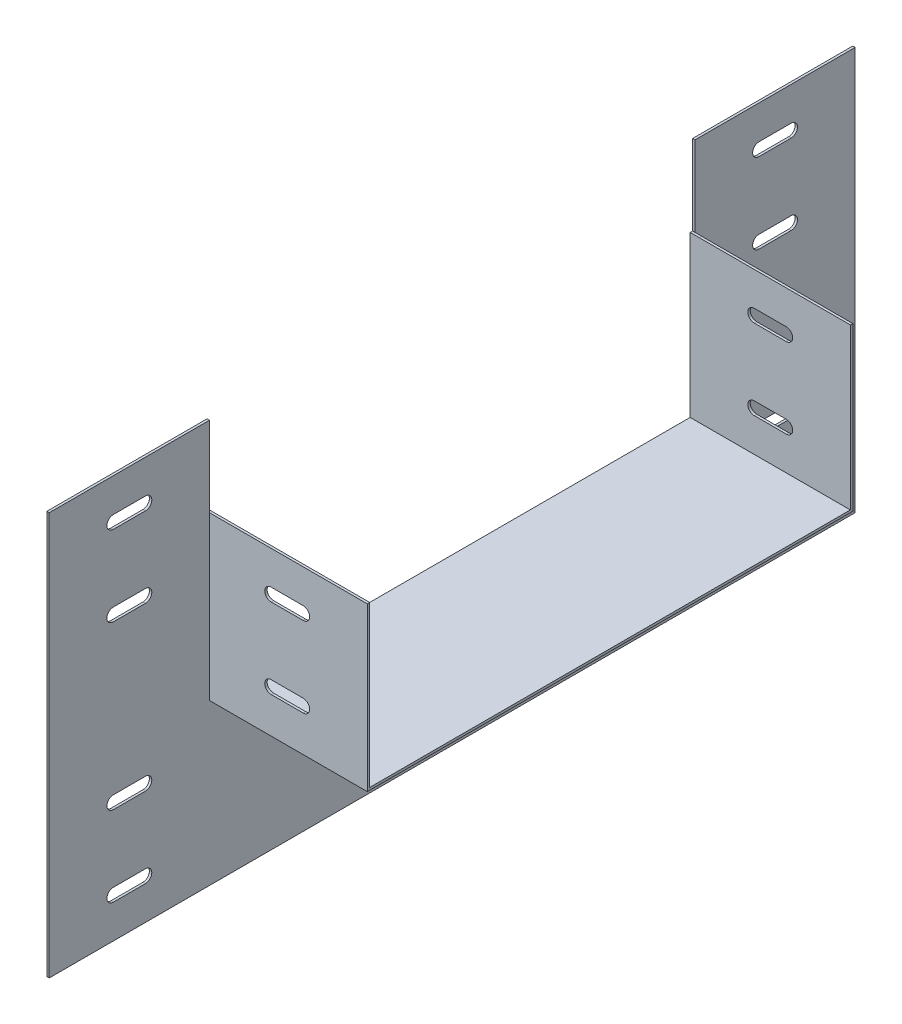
ISO-10303-21;
HEADER;
FILE_DESCRIPTION(('STEP AP214'),'2;1');
FILE_NAME('part.step','',(''),(''),'','','');
FILE_SCHEMA(('AUTOMOTIVE_DESIGN { 1 0 10303 214 1 1 1 1 }'));
ENDSEC;
DATA;
#1=APPLICATION_CONTEXT('core data for automotive mechanical design processes');
#2=APPLICATION_PROTOCOL_DEFINITION('international standard','automotive_design',2000,#1);
#3=PRODUCT_CONTEXT('',#1,'mechanical');
#4=PRODUCT('Part','Part','',(#3));
#5=PRODUCT_RELATED_PRODUCT_CATEGORY('part','',(#4));
#6=PRODUCT_DEFINITION_FORMATION('','',#4);
#7=PRODUCT_DEFINITION_CONTEXT('part definition',#1,'design');
#8=PRODUCT_DEFINITION('design','',#6,#7);
#9=PRODUCT_DEFINITION_SHAPE('','',#8);
#10=(LENGTH_UNIT() NAMED_UNIT(*) SI_UNIT(.MILLI.,.METRE.));
#11=(NAMED_UNIT(*) PLANE_ANGLE_UNIT() SI_UNIT($,.RADIAN.));
#12=(NAMED_UNIT(*) SI_UNIT($,.STERADIAN.) SOLID_ANGLE_UNIT());
#13=UNCERTAINTY_MEASURE_WITH_UNIT(LENGTH_MEASURE(1.E-05),#10,'distance_accuracy_value','');
#14=(GEOMETRIC_REPRESENTATION_CONTEXT(3) GLOBAL_UNCERTAINTY_ASSIGNED_CONTEXT((#13)) GLOBAL_UNIT_ASSIGNED_CONTEXT((#10,
#11,#12)) REPRESENTATION_CONTEXT('',''));
#15=CARTESIAN_POINT('',(0.,0.,0.));
#16=DIRECTION('',(0.,0.,1.));
#17=DIRECTION('',(1.,0.,0.));
#18=AXIS2_PLACEMENT_3D('',#15,#16,#17);
#19=CARTESIAN_POINT('',(100.,-1.5,-150.));
#20=DIRECTION('',(1.,0.,0.));
#21=DIRECTION('',(0.,0.,-1.));
#22=AXIS2_PLACEMENT_3D('',#19,#20,#21);
#23=PLANE('',#22);
#24=DIRECTION('',(0.,0.,-1.));
#25=VECTOR('',#24,1.);
#26=CARTESIAN_POINT('',(100.,0.,-150.));
#27=LINE('',#26,#25);
#28=CARTESIAN_POINT('',(100.,0.,150.));
#29=VERTEX_POINT('',#28);
#30=CARTESIAN_POINT('',(100.,0.,-150.));
#31=VERTEX_POINT('',#30);
#32=EDGE_CURVE('E867',#29,#31,#27,.T.);
#33=ORIENTED_EDGE('',*,*,#32,.F.);
#34=DIRECTION('',(0.,1.,0.));
#35=VECTOR('',#34,1.);
#36=CARTESIAN_POINT('',(100.,-101.511249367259,150.));
#37=LINE('',#36,#35);
#38=CARTESIAN_POINT('',(100.,100.,150.));
#39=VERTEX_POINT('',#38);
#40=EDGE_CURVE('E861',#29,#39,#37,.T.);
#41=ORIENTED_EDGE('',*,*,#40,.T.);
#42=DIRECTION('',(0.,0.,1.));
#43=VECTOR('',#42,1.);
#44=CARTESIAN_POINT('',(100.,100.,150.));
#45=LINE('',#44,#43);
#46=CARTESIAN_POINT('',(100.,100.,151.5));
#47=VERTEX_POINT('',#46);
#48=EDGE_CURVE('E839',#39,#47,#45,.T.);
#49=ORIENTED_EDGE('',*,*,#48,.T.);
#50=DIRECTION('',(0.,1.,0.));
#51=VECTOR('',#50,1.);
#52=CARTESIAN_POINT('',(100.,-101.511249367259,151.5));
#53=LINE('',#52,#51);
#54=CARTESIAN_POINT('',(100.,-1.5,151.5));
#55=VERTEX_POINT('',#54);
#56=EDGE_CURVE('E849',#55,#47,#53,.T.);
#57=ORIENTED_EDGE('',*,*,#56,.F.);
#58=DIRECTION('',(0.,0.,-1.));
#59=VECTOR('',#58,1.);
#60=CARTESIAN_POINT('',(100.,-1.5,-150.));
#61=LINE('',#60,#59);
#62=CARTESIAN_POINT('',(100.,-1.5,-151.5));
#63=VERTEX_POINT('',#62);
#64=EDGE_CURVE('E863',#55,#63,#61,.T.);
#65=ORIENTED_EDGE('',*,*,#64,.T.);
#66=DIRECTION('',(0.,-1.,0.));
#67=VECTOR('',#66,1.);
#68=CARTESIAN_POINT('',(100.,100.,-151.5));
#69=LINE('',#68,#67);
#70=CARTESIAN_POINT('',(100.,100.,-151.5));
#71=VERTEX_POINT('',#70);
#72=EDGE_CURVE('E824',#71,#63,#69,.T.);
#73=ORIENTED_EDGE('',*,*,#72,.F.);
#74=DIRECTION('',(0.,0.,1.));
#75=VECTOR('',#74,1.);
#76=CARTESIAN_POINT('',(100.,100.,-151.5));
#77=LINE('',#76,#75);
#78=CARTESIAN_POINT('',(100.,100.,-150.));
#79=VERTEX_POINT('',#78);
#80=EDGE_CURVE('E821',#71,#79,#77,.T.);
#81=ORIENTED_EDGE('',*,*,#80,.T.);
#82=DIRECTION('',(0.,-1.,0.));
#83=VECTOR('',#82,1.);
#84=CARTESIAN_POINT('',(100.,100.,-150.));
#85=LINE('',#84,#83);
#86=EDGE_CURVE('E827',#79,#31,#85,.T.);
#87=ORIENTED_EDGE('',*,*,#86,.T.);
#88=EDGE_LOOP('',(#33,#41,#49,#57,#65,#73,#81,#87));
#89=FACE_BOUND('',#88,.T.);
#90=ADVANCED_FACE('F32',(#89),#23,.T.);
#91=CARTESIAN_POINT('',(0.,-1.5,-150.));
#92=DIRECTION('',(-1.,0.,0.));
#93=DIRECTION('',(0.,0.,1.));
#94=AXIS2_PLACEMENT_3D('',#91,#92,#93);
#95=PLANE('',#94);
#96=CARTESIAN_POINT('',(0.,-76.5,-191.5));
#97=DIRECTION('',(-1.,0.,0.));
#98=DIRECTION('',(0.,0.,1.));
#99=AXIS2_PLACEMENT_3D('',#96,#97,#98);
#100=CIRCLE('',#99,4.);
#101=CARTESIAN_POINT('',(0.,-80.5,-191.5));
#102=VERTEX_POINT('',#101);
#103=CARTESIAN_POINT('',(0.,-72.5,-191.5));
#104=VERTEX_POINT('',#103);
#105=EDGE_CURVE('E460',#102,#104,#100,.T.);
#106=ORIENTED_EDGE('',*,*,#105,.F.);
#107=DIRECTION('',(0.,0.,1.));
#108=VECTOR('',#107,1.);
#109=CARTESIAN_POINT('',(0.,-80.5,-150.));
#110=LINE('',#109,#108);
#111=CARTESIAN_POINT('',(0.,-80.5,-211.5));
#112=VERTEX_POINT('',#111);
#113=EDGE_CURVE('E453',#112,#102,#110,.T.);
#114=ORIENTED_EDGE('',*,*,#113,.F.);
#115=CARTESIAN_POINT('',(0.,-76.5,-211.5));
#116=DIRECTION('',(-1.,0.,0.));
#117=DIRECTION('',(0.,0.,1.));
#118=AXIS2_PLACEMENT_3D('',#115,#116,#117);
#119=CIRCLE('',#118,4.);
#120=CARTESIAN_POINT('',(0.,-72.5,-211.5));
#121=VERTEX_POINT('',#120);
#122=EDGE_CURVE('E433',#121,#112,#119,.T.);
#123=ORIENTED_EDGE('',*,*,#122,.F.);
#124=DIRECTION('',(0.,0.,-1.));
#125=VECTOR('',#124,1.);
#126=CARTESIAN_POINT('',(0.,-72.5,-150.));
#127=LINE('',#126,#125);
#128=EDGE_CURVE('E458',#104,#121,#127,.T.);
#129=ORIENTED_EDGE('',*,*,#128,.F.);
#130=EDGE_LOOP('',(#106,#114,#123,#129));
#131=FACE_BOUND('',#130,.T.);
#132=CARTESIAN_POINT('',(0.,-26.5,-191.5));
#133=DIRECTION('',(-1.,0.,0.));
#134=DIRECTION('',(0.,0.,1.));
#135=AXIS2_PLACEMENT_3D('',#132,#133,#134);
#136=CIRCLE('',#135,4.);
#137=CARTESIAN_POINT('',(0.,-30.5,-191.5));
#138=VERTEX_POINT('',#137);
#139=CARTESIAN_POINT('',(0.,-22.5,-191.5));
#140=VERTEX_POINT('',#139);
#141=EDGE_CURVE('E489',#138,#140,#136,.T.);
#142=ORIENTED_EDGE('',*,*,#141,.F.);
#143=DIRECTION('',(0.,0.,1.));
#144=VECTOR('',#143,1.);
#145=CARTESIAN_POINT('',(0.,-30.5,-150.));
#146=LINE('',#145,#144);
#147=CARTESIAN_POINT('',(0.,-30.5,-211.5));
#148=VERTEX_POINT('',#147);
#149=EDGE_CURVE('E476',#148,#138,#146,.T.);
#150=ORIENTED_EDGE('',*,*,#149,.F.);
#151=CARTESIAN_POINT('',(0.,-26.5,-211.5));
#152=DIRECTION('',(-1.,0.,0.));
#153=DIRECTION('',(0.,0.,1.));
#154=AXIS2_PLACEMENT_3D('',#151,#152,#153);
#155=CIRCLE('',#154,4.);
#156=CARTESIAN_POINT('',(0.,-22.5,-211.5));
#157=VERTEX_POINT('',#156);
#158=EDGE_CURVE('E484',#157,#148,#155,.T.);
#159=ORIENTED_EDGE('',*,*,#158,.F.);
#160=DIRECTION('',(0.,0.,-1.));
#161=VECTOR('',#160,1.);
#162=CARTESIAN_POINT('',(0.,-22.5,-150.));
#163=LINE('',#162,#161);
#164=EDGE_CURVE('E487',#140,#157,#163,.T.);
#165=ORIENTED_EDGE('',*,*,#164,.F.);
#166=EDGE_LOOP('',(#142,#150,#159,#165));
#167=FACE_BOUND('',#166,.T.);
#168=CARTESIAN_POINT('',(0.,75.,-191.5));
#169=DIRECTION('',(-1.,0.,0.));
#170=DIRECTION('',(0.,0.,1.));
#171=AXIS2_PLACEMENT_3D('',#168,#169,#170);
#172=CIRCLE('',#171,4.);
#173=CARTESIAN_POINT('',(0.,71.,-191.5));
#174=VERTEX_POINT('',#173);
#175=CARTESIAN_POINT('',(0.,79.,-191.5));
#176=VERTEX_POINT('',#175);
#177=EDGE_CURVE('E518',#174,#176,#172,.T.);
#178=ORIENTED_EDGE('',*,*,#177,.F.);
#179=DIRECTION('',(0.,0.,1.));
#180=VECTOR('',#179,1.);
#181=CARTESIAN_POINT('',(0.,71.,-150.));
#182=LINE('',#181,#180);
#183=CARTESIAN_POINT('',(0.,71.,-211.5));
#184=VERTEX_POINT('',#183);
#185=EDGE_CURVE('E505',#184,#174,#182,.T.);
#186=ORIENTED_EDGE('',*,*,#185,.F.);
#187=CARTESIAN_POINT('',(0.,75.,-211.5));
#188=DIRECTION('',(-1.,0.,0.));
#189=DIRECTION('',(0.,0.,1.));
#190=AXIS2_PLACEMENT_3D('',#187,#188,#189);
#191=CIRCLE('',#190,4.);
#192=CARTESIAN_POINT('',(0.,79.,-211.5));
#193=VERTEX_POINT('',#192);
#194=EDGE_CURVE('E513',#193,#184,#191,.T.);
#195=ORIENTED_EDGE('',*,*,#194,.F.);
#196=DIRECTION('',(0.,0.,-1.));
#197=VECTOR('',#196,1.);
#198=CARTESIAN_POINT('',(0.,79.,-150.));
#199=LINE('',#198,#197);
#200=EDGE_CURVE('E516',#176,#193,#199,.T.);
#201=ORIENTED_EDGE('',*,*,#200,.F.);
#202=EDGE_LOOP('',(#178,#186,#195,#201));
#203=FACE_BOUND('',#202,.T.);
#204=CARTESIAN_POINT('',(0.,125.,-191.5));
#205=DIRECTION('',(-1.,0.,0.));
#206=DIRECTION('',(0.,0.,1.));
#207=AXIS2_PLACEMENT_3D('',#204,#205,#206);
#208=CIRCLE('',#207,4.);
#209=CARTESIAN_POINT('',(0.,121.,-191.5));
#210=VERTEX_POINT('',#209);
#211=CARTESIAN_POINT('',(0.,129.,-191.5));
#212=VERTEX_POINT('',#211);
#213=EDGE_CURVE('E547',#210,#212,#208,.T.);
#214=ORIENTED_EDGE('',*,*,#213,.F.);
#215=DIRECTION('',(0.,0.,1.));
#216=VECTOR('',#215,1.);
#217=CARTESIAN_POINT('',(0.,121.,-150.));
#218=LINE('',#217,#216);
#219=CARTESIAN_POINT('',(0.,121.,-211.5));
#220=VERTEX_POINT('',#219);
#221=EDGE_CURVE('E534',#220,#210,#218,.T.);
#222=ORIENTED_EDGE('',*,*,#221,.F.);
#223=CARTESIAN_POINT('',(0.,125.,-211.5));
#224=DIRECTION('',(-1.,0.,0.));
#225=DIRECTION('',(0.,0.,1.));
#226=AXIS2_PLACEMENT_3D('',#223,#224,#225);
#227=CIRCLE('',#226,4.);
#228=CARTESIAN_POINT('',(0.,129.,-211.5));
#229=VERTEX_POINT('',#228);
#230=EDGE_CURVE('E542',#229,#220,#227,.T.);
#231=ORIENTED_EDGE('',*,*,#230,.F.);
#232=DIRECTION('',(0.,0.,-1.));
#233=VECTOR('',#232,1.);
#234=CARTESIAN_POINT('',(0.,129.,-150.));
#235=LINE('',#234,#233);
#236=EDGE_CURVE('E545',#212,#229,#235,.T.);
#237=ORIENTED_EDGE('',*,*,#236,.F.);
#238=EDGE_LOOP('',(#214,#222,#231,#237));
#239=FACE_BOUND('',#238,.T.);
#240=CARTESIAN_POINT('',(0.,-76.5,211.5));
#241=DIRECTION('',(-1.,0.,0.));
#242=DIRECTION('',(0.,0.,1.));
#243=AXIS2_PLACEMENT_3D('',#240,#241,#242);
#244=CIRCLE('',#243,4.);
#245=CARTESIAN_POINT('',(0.,-80.5,211.5));
#246=VERTEX_POINT('',#245);
#247=CARTESIAN_POINT('',(0.,-72.5,211.5));
#248=VERTEX_POINT('',#247);
#249=EDGE_CURVE('E576',#246,#248,#244,.T.);
#250=ORIENTED_EDGE('',*,*,#249,.F.);
#251=DIRECTION('',(0.,0.,1.));
#252=VECTOR('',#251,1.);
#253=CARTESIAN_POINT('',(0.,-80.5,-150.));
#254=LINE('',#253,#252);
#255=CARTESIAN_POINT('',(0.,-80.5,191.5));
#256=VERTEX_POINT('',#255);
#257=EDGE_CURVE('E563',#256,#246,#254,.T.);
#258=ORIENTED_EDGE('',*,*,#257,.F.);
#259=CARTESIAN_POINT('',(0.,-76.5,191.5));
#260=DIRECTION('',(-1.,0.,0.));
#261=DIRECTION('',(0.,0.,1.));
#262=AXIS2_PLACEMENT_3D('',#259,#260,#261);
#263=CIRCLE('',#262,4.);
#264=CARTESIAN_POINT('',(0.,-72.5,191.5));
#265=VERTEX_POINT('',#264);
#266=EDGE_CURVE('E571',#265,#256,#263,.T.);
#267=ORIENTED_EDGE('',*,*,#266,.F.);
#268=DIRECTION('',(0.,0.,-1.));
#269=VECTOR('',#268,1.);
#270=CARTESIAN_POINT('',(0.,-72.5,-150.));
#271=LINE('',#270,#269);
#272=EDGE_CURVE('E574',#248,#265,#271,.T.);
#273=ORIENTED_EDGE('',*,*,#272,.F.);
#274=EDGE_LOOP('',(#250,#258,#267,#273));
#275=FACE_BOUND('',#274,.T.);
#276=CARTESIAN_POINT('',(0.,-26.5,211.5));
#277=DIRECTION('',(-1.,0.,0.));
#278=DIRECTION('',(0.,0.,1.));
#279=AXIS2_PLACEMENT_3D('',#276,#277,#278);
#280=CIRCLE('',#279,4.00000000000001);
#281=CARTESIAN_POINT('',(0.,-30.5,211.5));
#282=VERTEX_POINT('',#281);
#283=CARTESIAN_POINT('',(0.,-22.5,211.5));
#284=VERTEX_POINT('',#283);
#285=EDGE_CURVE('E605',#282,#284,#280,.T.);
#286=ORIENTED_EDGE('',*,*,#285,.F.);
#287=DIRECTION('',(0.,0.,1.));
#288=VECTOR('',#287,1.);
#289=CARTESIAN_POINT('',(0.,-30.5,-150.));
#290=LINE('',#289,#288);
#291=CARTESIAN_POINT('',(0.,-30.5,191.5));
#292=VERTEX_POINT('',#291);
#293=EDGE_CURVE('E592',#292,#282,#290,.T.);
#294=ORIENTED_EDGE('',*,*,#293,.F.);
#295=CARTESIAN_POINT('',(0.,-26.5,191.5));
#296=DIRECTION('',(-1.,0.,0.));
#297=DIRECTION('',(0.,0.,1.));
#298=AXIS2_PLACEMENT_3D('',#295,#296,#297);
#299=CIRCLE('',#298,4.00000000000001);
#300=CARTESIAN_POINT('',(0.,-22.5,191.5));
#301=VERTEX_POINT('',#300);
#302=EDGE_CURVE('E600',#301,#292,#299,.T.);
#303=ORIENTED_EDGE('',*,*,#302,.F.);
#304=DIRECTION('',(0.,0.,-1.));
#305=VECTOR('',#304,1.);
#306=CARTESIAN_POINT('',(0.,-22.4999999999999,-150.));
#307=LINE('',#306,#305);
#308=EDGE_CURVE('E603',#284,#301,#307,.T.);
#309=ORIENTED_EDGE('',*,*,#308,.F.);
#310=EDGE_LOOP('',(#286,#294,#303,#309));
#311=FACE_BOUND('',#310,.T.);
#312=CARTESIAN_POINT('',(0.,75.,211.5));
#313=DIRECTION('',(-1.,0.,0.));
#314=DIRECTION('',(0.,0.,1.));
#315=AXIS2_PLACEMENT_3D('',#312,#313,#314);
#316=CIRCLE('',#315,4.);
#317=CARTESIAN_POINT('',(0.,71.,211.5));
#318=VERTEX_POINT('',#317);
#319=CARTESIAN_POINT('',(0.,79.,211.5));
#320=VERTEX_POINT('',#319);
#321=EDGE_CURVE('E634',#318,#320,#316,.T.);
#322=ORIENTED_EDGE('',*,*,#321,.F.);
#323=DIRECTION('',(0.,0.,1.));
#324=VECTOR('',#323,1.);
#325=CARTESIAN_POINT('',(0.,71.,-150.));
#326=LINE('',#325,#324);
#327=CARTESIAN_POINT('',(0.,71.,191.5));
#328=VERTEX_POINT('',#327);
#329=EDGE_CURVE('E621',#328,#318,#326,.T.);
#330=ORIENTED_EDGE('',*,*,#329,.F.);
#331=CARTESIAN_POINT('',(0.,75.,191.5));
#332=DIRECTION('',(-1.,0.,0.));
#333=DIRECTION('',(0.,0.,1.));
#334=AXIS2_PLACEMENT_3D('',#331,#332,#333);
#335=CIRCLE('',#334,4.);
#336=CARTESIAN_POINT('',(0.,79.,191.5));
#337=VERTEX_POINT('',#336);
#338=EDGE_CURVE('E629',#337,#328,#335,.T.);
#339=ORIENTED_EDGE('',*,*,#338,.F.);
#340=DIRECTION('',(0.,0.,-1.));
#341=VECTOR('',#340,1.);
#342=CARTESIAN_POINT('',(0.,79.,-150.));
#343=LINE('',#342,#341);
#344=EDGE_CURVE('E632',#320,#337,#343,.T.);
#345=ORIENTED_EDGE('',*,*,#344,.F.);
#346=EDGE_LOOP('',(#322,#330,#339,#345));
#347=FACE_BOUND('',#346,.T.);
#348=CARTESIAN_POINT('',(0.,125.,211.5));
#349=DIRECTION('',(-1.,0.,0.));
#350=DIRECTION('',(0.,0.,1.));
#351=AXIS2_PLACEMENT_3D('',#348,#349,#350);
#352=CIRCLE('',#351,4.);
#353=CARTESIAN_POINT('',(0.,121.,211.5));
#354=VERTEX_POINT('',#353);
#355=CARTESIAN_POINT('',(0.,129.,211.5));
#356=VERTEX_POINT('',#355);
#357=EDGE_CURVE('E663',#354,#356,#352,.T.);
#358=ORIENTED_EDGE('',*,*,#357,.F.);
#359=DIRECTION('',(0.,0.,1.));
#360=VECTOR('',#359,1.);
#361=CARTESIAN_POINT('',(0.,121.,-150.));
#362=LINE('',#361,#360);
#363=CARTESIAN_POINT('',(0.,121.,191.5));
#364=VERTEX_POINT('',#363);
#365=EDGE_CURVE('E650',#364,#354,#362,.T.);
#366=ORIENTED_EDGE('',*,*,#365,.F.);
#367=CARTESIAN_POINT('',(0.,125.,191.5));
#368=DIRECTION('',(-1.,0.,0.));
#369=DIRECTION('',(0.,0.,1.));
#370=AXIS2_PLACEMENT_3D('',#367,#368,#369);
#371=CIRCLE('',#370,4.);
#372=CARTESIAN_POINT('',(0.,129.,191.5));
#373=VERTEX_POINT('',#372);
#374=EDGE_CURVE('E658',#373,#364,#371,.T.);
#375=ORIENTED_EDGE('',*,*,#374,.F.);
#376=DIRECTION('',(0.,0.,-1.));
#377=VECTOR('',#376,1.);
#378=CARTESIAN_POINT('',(0.,129.,-150.));
#379=LINE('',#378,#377);
#380=EDGE_CURVE('E661',#356,#373,#379,.T.);
#381=ORIENTED_EDGE('',*,*,#380,.F.);
#382=EDGE_LOOP('',(#358,#366,#375,#381));
#383=FACE_BOUND('',#382,.T.);
#384=DIRECTION('',(0.,1.,0.));
#385=VECTOR('',#384,1.);
#386=CARTESIAN_POINT('',(0.,150.,151.5));
#387=LINE('',#386,#385);
#388=CARTESIAN_POINT('',(0.,100.,151.5));
#389=VERTEX_POINT('',#388);
#390=CARTESIAN_POINT('',(0.,150.,151.5));
#391=VERTEX_POINT('',#390);
#392=EDGE_CURVE('E760',#389,#391,#387,.T.);
#393=ORIENTED_EDGE('',*,*,#392,.F.);
#394=DIRECTION('',(0.,0.,-1.));
#395=VECTOR('',#394,1.);
#396=CARTESIAN_POINT('',(0.,100.,151.5));
#397=LINE('',#396,#395);
#398=CARTESIAN_POINT('',(0.,100.,150.));
#399=VERTEX_POINT('',#398);
#400=EDGE_CURVE('E846',#389,#399,#397,.T.);
#401=ORIENTED_EDGE('',*,*,#400,.T.);
#402=DIRECTION('',(0.,1.,0.));
#403=VECTOR('',#402,1.);
#404=CARTESIAN_POINT('',(0.,-101.511249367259,150.));
#405=LINE('',#404,#403);
#406=CARTESIAN_POINT('',(0.,0.,150.));
#407=VERTEX_POINT('',#406);
#408=EDGE_CURVE('E854',#407,#399,#405,.T.);
#409=ORIENTED_EDGE('',*,*,#408,.F.);
#410=DIRECTION('',(0.,0.,1.));
#411=VECTOR('',#410,1.);
#412=CARTESIAN_POINT('',(0.,0.,-150.));
#413=LINE('',#412,#411);
#414=CARTESIAN_POINT('',(0.,0.,-150.));
#415=VERTEX_POINT('',#414);
#416=EDGE_CURVE('E876',#415,#407,#413,.T.);
#417=ORIENTED_EDGE('',*,*,#416,.F.);
#418=DIRECTION('',(0.,-1.,0.));
#419=VECTOR('',#418,1.);
#420=CARTESIAN_POINT('',(0.,100.,-150.));
#421=LINE('',#420,#419);
#422=CARTESIAN_POINT('',(0.,100.,-150.));
#423=VERTEX_POINT('',#422);
#424=EDGE_CURVE('E835',#423,#415,#421,.T.);
#425=ORIENTED_EDGE('',*,*,#424,.F.);
#426=DIRECTION('',(0.,0.,-1.));
#427=VECTOR('',#426,1.);
#428=CARTESIAN_POINT('',(0.,100.,-150.));
#429=LINE('',#428,#427);
#430=CARTESIAN_POINT('',(0.,100.,-151.5));
#431=VERTEX_POINT('',#430);
#432=EDGE_CURVE('E815',#423,#431,#429,.T.);
#433=ORIENTED_EDGE('',*,*,#432,.T.);
#434=DIRECTION('',(0.,-1.,0.));
#435=VECTOR('',#434,1.);
#436=CARTESIAN_POINT('',(0.,150.,-151.5));
#437=LINE('',#436,#435);
#438=CARTESIAN_POINT('',(0.,150.,-151.5));
#439=VERTEX_POINT('',#438);
#440=EDGE_CURVE('E789',#439,#431,#437,.T.);
#441=ORIENTED_EDGE('',*,*,#440,.F.);
#442=DIRECTION('',(0.,0.,1.));
#443=VECTOR('',#442,1.);
#444=CARTESIAN_POINT('',(0.,150.,-251.5));
#445=LINE('',#444,#443);
#446=CARTESIAN_POINT('',(0.,150.,-251.5));
#447=VERTEX_POINT('',#446);
#448=EDGE_CURVE('E787',#447,#439,#445,.T.);
#449=ORIENTED_EDGE('',*,*,#448,.F.);
#450=DIRECTION('',(0.,1.,0.));
#451=VECTOR('',#450,1.);
#452=CARTESIAN_POINT('',(0.,-101.5,-251.5));
#453=LINE('',#452,#451);
#454=CARTESIAN_POINT('',(0.,-101.5,-251.5));
#455=VERTEX_POINT('',#454);
#456=EDGE_CURVE('E785',#455,#447,#453,.T.);
#457=ORIENTED_EDGE('',*,*,#456,.F.);
#458=DIRECTION('',(0.,0.,-1.));
#459=VECTOR('',#458,1.);
#460=CARTESIAN_POINT('',(0.,-101.5,251.5));
#461=LINE('',#460,#459);
#462=CARTESIAN_POINT('',(0.,-101.5,251.5));
#463=VERTEX_POINT('',#462);
#464=EDGE_CURVE('E783',#463,#455,#461,.T.);
#465=ORIENTED_EDGE('',*,*,#464,.F.);
#466=DIRECTION('',(0.,-1.,0.));
#467=VECTOR('',#466,1.);
#468=CARTESIAN_POINT('',(0.,150.,251.5));
#469=LINE('',#468,#467);
#470=CARTESIAN_POINT('',(0.,150.,251.5));
#471=VERTEX_POINT('',#470);
#472=EDGE_CURVE('E781',#471,#463,#469,.T.);
#473=ORIENTED_EDGE('',*,*,#472,.F.);
#474=DIRECTION('',(0.,0.,1.));
#475=VECTOR('',#474,1.);
#476=CARTESIAN_POINT('',(0.,150.,151.5));
#477=LINE('',#476,#475);
#478=EDGE_CURVE('E755',#391,#471,#477,.T.);
#479=ORIENTED_EDGE('',*,*,#478,.F.);
#480=EDGE_LOOP('',(#393,#401,#409,#417,#425,#433,#441,#449,#457,#465,#473,#479));
#481=FACE_BOUND('',#480,.T.);
#482=ADVANCED_FACE('F34',(#131,#167,#203,#239,#275,#311,#347,#383,#481),#95,.T.);
#483=CARTESIAN_POINT('',(0.,-1.5,0.));
#484=DIRECTION('',(0.,1.,0.));
#485=DIRECTION('',(0.,0.,1.));
#486=AXIS2_PLACEMENT_3D('',#483,#484,#485);
#487=PLANE('',#486);
#488=DIRECTION('',(-1.,0.,0.));
#489=VECTOR('',#488,1.);
#490=CARTESIAN_POINT('',(0.,-1.5,151.5));
#491=LINE('',#490,#489);
#492=CARTESIAN_POINT('',(1.5,-1.5,151.5));
#493=VERTEX_POINT('',#492);
#494=EDGE_CURVE('E850',#55,#493,#491,.T.);
#495=ORIENTED_EDGE('',*,*,#494,.T.);
#496=DIRECTION('',(0.,0.,1.));
#497=VECTOR('',#496,1.);
#498=CARTESIAN_POINT('',(1.5,-1.5,-151.5));
#499=LINE('',#498,#497);
#500=CARTESIAN_POINT('',(1.5,-1.5,-151.5));
#501=VERTEX_POINT('',#500);
#502=EDGE_CURVE('E772',#501,#493,#499,.T.);
#503=ORIENTED_EDGE('',*,*,#502,.F.);
#504=DIRECTION('',(1.,0.,0.));
#505=VECTOR('',#504,1.);
#506=CARTESIAN_POINT('',(100.,-1.5,-151.5));
#507=LINE('',#506,#505);
#508=EDGE_CURVE('E809',#501,#63,#507,.T.);
#509=ORIENTED_EDGE('',*,*,#508,.T.);
#510=ORIENTED_EDGE('',*,*,#64,.F.);
#511=EDGE_LOOP('',(#495,#503,#509,#510));
#512=FACE_BOUND('',#511,.T.);
#513=ADVANCED_FACE('F944',(#512),#487,.F.);
#514=CARTESIAN_POINT('',(0.,0.,0.));
#515=DIRECTION('',(0.,1.,0.));
#516=DIRECTION('',(0.,0.,1.));
#517=AXIS2_PLACEMENT_3D('',#514,#515,#516);
#518=PLANE('',#517);
#519=DIRECTION('',(-1.,0.,0.));
#520=VECTOR('',#519,1.);
#521=CARTESIAN_POINT('',(100.,0.,-150.));
#522=LINE('',#521,#520);
#523=EDGE_CURVE('E853',#31,#415,#522,.T.);
#524=ORIENTED_EDGE('',*,*,#523,.T.);
#525=ORIENTED_EDGE('',*,*,#416,.T.);
#526=DIRECTION('',(1.,0.,0.));
#527=VECTOR('',#526,1.);
#528=CARTESIAN_POINT('',(100.,0.,150.));
#529=LINE('',#528,#527);
#530=EDGE_CURVE('E1041',#407,#29,#529,.T.);
#531=ORIENTED_EDGE('',*,*,#530,.T.);
#532=ORIENTED_EDGE('',*,*,#32,.T.);
#533=EDGE_LOOP('',(#524,#525,#531,#532));
#534=FACE_BOUND('',#533,.T.);
#535=ADVANCED_FACE('F948',(#534),#518,.T.);
#536=CARTESIAN_POINT('',(0.,-101.511249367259,150.));
#537=DIRECTION('',(0.,0.,1.));
#538=DIRECTION('',(1.,0.,0.));
#539=AXIS2_PLACEMENT_3D('',#536,#537,#538);
#540=PLANE('',#539);
#541=DIRECTION('',(-1.,0.,0.));
#542=VECTOR('',#541,1.);
#543=CARTESIAN_POINT('',(0.,29.,150.));
#544=LINE('',#543,#542);
#545=CARTESIAN_POINT('',(60.0000000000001,29.,150.));
#546=VERTEX_POINT('',#545);
#547=CARTESIAN_POINT('',(40.0000000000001,29.,150.));
#548=VERTEX_POINT('',#547);
#549=EDGE_CURVE('E698',#546,#548,#544,.T.);
#550=ORIENTED_EDGE('',*,*,#549,.T.);
#551=CARTESIAN_POINT('',(40.0000000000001,25.,150.));
#552=DIRECTION('',(0.,0.,1.));
#553=DIRECTION('',(1.,0.,0.));
#554=AXIS2_PLACEMENT_3D('',#551,#552,#553);
#555=CIRCLE('',#554,4.);
#556=CARTESIAN_POINT('',(40.0000000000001,21.,150.));
#557=VERTEX_POINT('',#556);
#558=EDGE_CURVE('E707',#548,#557,#555,.T.);
#559=ORIENTED_EDGE('',*,*,#558,.T.);
#560=DIRECTION('',(1.,0.,0.));
#561=VECTOR('',#560,1.);
#562=CARTESIAN_POINT('',(0.,21.,150.));
#563=LINE('',#562,#561);
#564=CARTESIAN_POINT('',(60.0000000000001,21.,150.));
#565=VERTEX_POINT('',#564);
#566=EDGE_CURVE('E684',#557,#565,#563,.T.);
#567=ORIENTED_EDGE('',*,*,#566,.T.);
#568=CARTESIAN_POINT('',(60.0000000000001,25.,150.));
#569=DIRECTION('',(0.,0.,1.));
#570=DIRECTION('',(1.,0.,0.));
#571=AXIS2_PLACEMENT_3D('',#568,#569,#570);
#572=CIRCLE('',#571,4.);
#573=EDGE_CURVE('E691',#565,#546,#572,.T.);
#574=ORIENTED_EDGE('',*,*,#573,.T.);
#575=EDGE_LOOP('',(#550,#559,#567,#574));
#576=FACE_BOUND('',#575,.T.);
#577=DIRECTION('',(-1.,0.,0.));
#578=VECTOR('',#577,1.);
#579=CARTESIAN_POINT('',(0.,79.,150.));
#580=LINE('',#579,#578);
#581=CARTESIAN_POINT('',(60.0000000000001,79.,150.));
#582=VERTEX_POINT('',#581);
#583=CARTESIAN_POINT('',(40.0000000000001,79.,150.));
#584=VERTEX_POINT('',#583);
#585=EDGE_CURVE('E743',#582,#584,#580,.T.);
#586=ORIENTED_EDGE('',*,*,#585,.T.);
#587=CARTESIAN_POINT('',(40.0000000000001,75.,150.));
#588=DIRECTION('',(0.,0.,1.));
#589=DIRECTION('',(1.,0.,0.));
#590=AXIS2_PLACEMENT_3D('',#587,#588,#589);
#591=CIRCLE('',#590,4.);
#592=CARTESIAN_POINT('',(40.0000000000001,71.,150.));
#593=VERTEX_POINT('',#592);
#594=EDGE_CURVE('E752',#584,#593,#591,.T.);
#595=ORIENTED_EDGE('',*,*,#594,.T.);
#596=DIRECTION('',(1.,0.,0.));
#597=VECTOR('',#596,1.);
#598=CARTESIAN_POINT('',(0.,71.,150.));
#599=LINE('',#598,#597);
#600=CARTESIAN_POINT('',(60.0000000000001,71.,150.));
#601=VERTEX_POINT('',#600);
#602=EDGE_CURVE('E729',#593,#601,#599,.T.);
#603=ORIENTED_EDGE('',*,*,#602,.T.);
#604=CARTESIAN_POINT('',(60.0000000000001,75.,150.));
#605=DIRECTION('',(0.,0.,1.));
#606=DIRECTION('',(1.,0.,0.));
#607=AXIS2_PLACEMENT_3D('',#604,#605,#606);
#608=CIRCLE('',#607,4.);
#609=EDGE_CURVE('E736',#601,#582,#608,.T.);
#610=ORIENTED_EDGE('',*,*,#609,.T.);
#611=EDGE_LOOP('',(#586,#595,#603,#610));
#612=FACE_BOUND('',#611,.T.);
#613=ORIENTED_EDGE('',*,*,#530,.F.);
#614=ORIENTED_EDGE('',*,*,#408,.T.);
#615=DIRECTION('',(1.,0.,0.));
#616=VECTOR('',#615,1.);
#617=CARTESIAN_POINT('',(0.,100.,150.));
#618=LINE('',#617,#616);
#619=EDGE_CURVE('E843',#399,#39,#618,.T.);
#620=ORIENTED_EDGE('',*,*,#619,.T.);
#621=ORIENTED_EDGE('',*,*,#40,.F.);
#622=EDGE_LOOP('',(#613,#614,#620,#621));
#623=FACE_BOUND('',#622,.T.);
#624=ADVANCED_FACE('F951',(#576,#612,#623),#540,.F.);
#625=CARTESIAN_POINT('',(0.,-101.511249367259,151.5));
#626=DIRECTION('',(0.,0.,1.));
#627=DIRECTION('',(1.,0.,0.));
#628=AXIS2_PLACEMENT_3D('',#625,#626,#627);
#629=PLANE('',#628);
#630=CARTESIAN_POINT('',(40.0000000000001,25.,151.5));
#631=DIRECTION('',(0.,0.,1.));
#632=DIRECTION('',(1.,0.,0.));
#633=AXIS2_PLACEMENT_3D('',#630,#631,#632);
#634=CIRCLE('',#633,4.);
#635=CARTESIAN_POINT('',(40.0000000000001,29.,151.5));
#636=VERTEX_POINT('',#635);
#637=CARTESIAN_POINT('',(40.0000000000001,21.,151.5));
#638=VERTEX_POINT('',#637);
#639=EDGE_CURVE('E704',#636,#638,#634,.T.);
#640=ORIENTED_EDGE('',*,*,#639,.F.);
#641=DIRECTION('',(-1.,0.,0.));
#642=VECTOR('',#641,1.);
#643=CARTESIAN_POINT('',(0.,29.,151.5));
#644=LINE('',#643,#642);
#645=CARTESIAN_POINT('',(60.0000000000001,29.,151.5));
#646=VERTEX_POINT('',#645);
#647=EDGE_CURVE('E696',#646,#636,#644,.T.);
#648=ORIENTED_EDGE('',*,*,#647,.F.);
#649=CARTESIAN_POINT('',(60.0000000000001,25.,151.5));
#650=DIRECTION('',(0.,0.,1.));
#651=DIRECTION('',(1.,0.,0.));
#652=AXIS2_PLACEMENT_3D('',#649,#650,#651);
#653=CIRCLE('',#652,4.);
#654=CARTESIAN_POINT('',(60.0000000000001,21.,151.5));
#655=VERTEX_POINT('',#654);
#656=EDGE_CURVE('E689',#655,#646,#653,.T.);
#657=ORIENTED_EDGE('',*,*,#656,.F.);
#658=DIRECTION('',(1.,0.,0.));
#659=VECTOR('',#658,1.);
#660=CARTESIAN_POINT('',(0.,21.,151.5));
#661=LINE('',#660,#659);
#662=EDGE_CURVE('E682',#638,#655,#661,.T.);
#663=ORIENTED_EDGE('',*,*,#662,.F.);
#664=EDGE_LOOP('',(#640,#648,#657,#663));
#665=FACE_BOUND('',#664,.T.);
#666=CARTESIAN_POINT('',(40.0000000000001,75.,151.5));
#667=DIRECTION('',(0.,0.,1.));
#668=DIRECTION('',(1.,0.,0.));
#669=AXIS2_PLACEMENT_3D('',#666,#667,#668);
#670=CIRCLE('',#669,4.);
#671=CARTESIAN_POINT('',(40.0000000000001,79.,151.5));
#672=VERTEX_POINT('',#671);
#673=CARTESIAN_POINT('',(40.0000000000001,71.,151.5));
#674=VERTEX_POINT('',#673);
#675=EDGE_CURVE('E749',#672,#674,#670,.T.);
#676=ORIENTED_EDGE('',*,*,#675,.F.);
#677=DIRECTION('',(-1.,0.,0.));
#678=VECTOR('',#677,1.);
#679=CARTESIAN_POINT('',(0.,79.,151.5));
#680=LINE('',#679,#678);
#681=CARTESIAN_POINT('',(60.0000000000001,79.,151.5));
#682=VERTEX_POINT('',#681);
#683=EDGE_CURVE('E741',#682,#672,#680,.T.);
#684=ORIENTED_EDGE('',*,*,#683,.F.);
#685=CARTESIAN_POINT('',(60.0000000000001,75.,151.5));
#686=DIRECTION('',(0.,0.,1.));
#687=DIRECTION('',(1.,0.,0.));
#688=AXIS2_PLACEMENT_3D('',#685,#686,#687);
#689=CIRCLE('',#688,4.);
#690=CARTESIAN_POINT('',(60.0000000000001,71.,151.5));
#691=VERTEX_POINT('',#690);
#692=EDGE_CURVE('E734',#691,#682,#689,.T.);
#693=ORIENTED_EDGE('',*,*,#692,.F.);
#694=DIRECTION('',(1.,0.,0.));
#695=VECTOR('',#694,1.);
#696=CARTESIAN_POINT('',(0.,71.,151.5));
#697=LINE('',#696,#695);
#698=EDGE_CURVE('E727',#674,#691,#697,.T.);
#699=ORIENTED_EDGE('',*,*,#698,.F.);
#700=EDGE_LOOP('',(#676,#684,#693,#699));
#701=FACE_BOUND('',#700,.T.);
#702=DIRECTION('',(0.,1.,0.));
#703=VECTOR('',#702,1.);
#704=CARTESIAN_POINT('',(1.5,150.,151.5));
#705=LINE('',#704,#703);
#706=CARTESIAN_POINT('',(1.5,100.,151.5));
#707=VERTEX_POINT('',#706);
#708=EDGE_CURVE('E775',#493,#707,#705,.T.);
#709=ORIENTED_EDGE('',*,*,#708,.F.);
#710=ORIENTED_EDGE('',*,*,#494,.F.);
#711=ORIENTED_EDGE('',*,*,#56,.T.);
#712=DIRECTION('',(1.,0.,0.));
#713=VECTOR('',#712,1.);
#714=CARTESIAN_POINT('',(0.,100.,151.5));
#715=LINE('',#714,#713);
#716=EDGE_CURVE('E840',#707,#47,#715,.T.);
#717=ORIENTED_EDGE('',*,*,#716,.F.);
#718=EDGE_LOOP('',(#709,#710,#711,#717));
#719=FACE_BOUND('',#718,.T.);
#720=ADVANCED_FACE('F956',(#665,#701,#719),#629,.T.);
#721=CARTESIAN_POINT('',(0.,100.,0.));
#722=DIRECTION('',(0.,-1.,0.));
#723=DIRECTION('',(-1.,0.,0.));
#724=AXIS2_PLACEMENT_3D('',#721,#722,#723);
#725=PLANE('',#724);
#726=EDGE_CURVE('E836',#389,#707,#715,.T.);
#727=ORIENTED_EDGE('',*,*,#726,.T.);
#728=ORIENTED_EDGE('',*,*,#716,.T.);
#729=ORIENTED_EDGE('',*,*,#48,.F.);
#730=ORIENTED_EDGE('',*,*,#619,.F.);
#731=ORIENTED_EDGE('',*,*,#400,.F.);
#732=EDGE_LOOP('',(#727,#728,#729,#730,#731));
#733=FACE_BOUND('',#732,.T.);
#734=ADVANCED_FACE('F959',(#733),#725,.F.);
#735=CARTESIAN_POINT('',(100.,100.,-150.));
#736=DIRECTION('',(0.,0.,1.));
#737=DIRECTION('',(1.,0.,0.));
#738=AXIS2_PLACEMENT_3D('',#735,#736,#737);
#739=PLANE('',#738);
#740=CARTESIAN_POINT('',(40.0000000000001,25.,-150.));
#741=DIRECTION('',(0.,0.,1.));
#742=DIRECTION('',(1.,0.,0.));
#743=AXIS2_PLACEMENT_3D('',#740,#741,#742);
#744=CIRCLE('',#743,4.);
#745=CARTESIAN_POINT('',(40.0000000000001,29.,-150.));
#746=VERTEX_POINT('',#745);
#747=CARTESIAN_POINT('',(40.0000000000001,21.,-150.));
#748=VERTEX_POINT('',#747);
#749=EDGE_CURVE('E701',#746,#748,#744,.T.);
#750=ORIENTED_EDGE('',*,*,#749,.F.);
#751=DIRECTION('',(-1.,0.,0.));
#752=VECTOR('',#751,1.);
#753=CARTESIAN_POINT('',(100.,29.,-150.));
#754=LINE('',#753,#752);
#755=CARTESIAN_POINT('',(60.0000000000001,29.,-150.));
#756=VERTEX_POINT('',#755);
#757=EDGE_CURVE('E694',#756,#746,#754,.T.);
#758=ORIENTED_EDGE('',*,*,#757,.F.);
#759=CARTESIAN_POINT('',(60.0000000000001,25.,-150.));
#760=DIRECTION('',(0.,0.,1.));
#761=DIRECTION('',(1.,0.,0.));
#762=AXIS2_PLACEMENT_3D('',#759,#760,#761);
#763=CIRCLE('',#762,4.);
#764=CARTESIAN_POINT('',(60.0000000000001,21.,-150.));
#765=VERTEX_POINT('',#764);
#766=EDGE_CURVE('E687',#765,#756,#763,.T.);
#767=ORIENTED_EDGE('',*,*,#766,.F.);
#768=DIRECTION('',(1.,0.,0.));
#769=VECTOR('',#768,1.);
#770=CARTESIAN_POINT('',(100.,21.,-150.));
#771=LINE('',#770,#769);
#772=EDGE_CURVE('E680',#748,#765,#771,.T.);
#773=ORIENTED_EDGE('',*,*,#772,.F.);
#774=EDGE_LOOP('',(#750,#758,#767,#773));
#775=FACE_BOUND('',#774,.T.);
#776=CARTESIAN_POINT('',(40.0000000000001,75.,-150.));
#777=DIRECTION('',(0.,0.,1.));
#778=DIRECTION('',(1.,0.,0.));
#779=AXIS2_PLACEMENT_3D('',#776,#777,#778);
#780=CIRCLE('',#779,4.);
#781=CARTESIAN_POINT('',(40.0000000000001,79.,-150.));
#782=VERTEX_POINT('',#781);
#783=CARTESIAN_POINT('',(40.0000000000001,71.,-150.));
#784=VERTEX_POINT('',#783);
#785=EDGE_CURVE('E746',#782,#784,#780,.T.);
#786=ORIENTED_EDGE('',*,*,#785,.F.);
#787=DIRECTION('',(-1.,0.,0.));
#788=VECTOR('',#787,1.);
#789=CARTESIAN_POINT('',(100.,79.,-150.));
#790=LINE('',#789,#788);
#791=CARTESIAN_POINT('',(60.0000000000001,79.,-150.));
#792=VERTEX_POINT('',#791);
#793=EDGE_CURVE('E739',#792,#782,#790,.T.);
#794=ORIENTED_EDGE('',*,*,#793,.F.);
#795=CARTESIAN_POINT('',(60.0000000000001,75.,-150.));
#796=DIRECTION('',(0.,0.,1.));
#797=DIRECTION('',(1.,0.,0.));
#798=AXIS2_PLACEMENT_3D('',#795,#796,#797);
#799=CIRCLE('',#798,4.);
#800=CARTESIAN_POINT('',(60.0000000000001,71.,-150.));
#801=VERTEX_POINT('',#800);
#802=EDGE_CURVE('E732',#801,#792,#799,.T.);
#803=ORIENTED_EDGE('',*,*,#802,.F.);
#804=DIRECTION('',(1.,0.,0.));
#805=VECTOR('',#804,1.);
#806=CARTESIAN_POINT('',(100.,71.,-150.));
#807=LINE('',#806,#805);
#808=EDGE_CURVE('E725',#784,#801,#807,.T.);
#809=ORIENTED_EDGE('',*,*,#808,.F.);
#810=EDGE_LOOP('',(#786,#794,#803,#809));
#811=FACE_BOUND('',#810,.T.);
#812=ORIENTED_EDGE('',*,*,#523,.F.);
#813=ORIENTED_EDGE('',*,*,#86,.F.);
#814=DIRECTION('',(-1.,0.,0.));
#815=VECTOR('',#814,1.);
#816=CARTESIAN_POINT('',(100.,100.,-150.));
#817=LINE('',#816,#815);
#818=EDGE_CURVE('E818',#79,#423,#817,.T.);
#819=ORIENTED_EDGE('',*,*,#818,.T.);
#820=ORIENTED_EDGE('',*,*,#424,.T.);
#821=EDGE_LOOP('',(#812,#813,#819,#820));
#822=FACE_BOUND('',#821,.T.);
#823=ADVANCED_FACE('F914',(#775,#811,#822),#739,.T.);
#824=CARTESIAN_POINT('',(100.,100.,-151.5));
#825=DIRECTION('',(0.,0.,1.));
#826=DIRECTION('',(1.,0.,0.));
#827=AXIS2_PLACEMENT_3D('',#824,#825,#826);
#828=PLANE('',#827);
#829=DIRECTION('',(-1.,0.,0.));
#830=VECTOR('',#829,1.);
#831=CARTESIAN_POINT('',(100.,29.,-151.5));
#832=LINE('',#831,#830);
#833=CARTESIAN_POINT('',(60.0000000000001,29.,-151.5));
#834=VERTEX_POINT('',#833);
#835=CARTESIAN_POINT('',(40.0000000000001,29.,-151.5));
#836=VERTEX_POINT('',#835);
#837=EDGE_CURVE('E40',#834,#836,#832,.T.);
#838=ORIENTED_EDGE('',*,*,#837,.T.);
#839=CARTESIAN_POINT('',(40.0000000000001,25.,-151.5));
#840=DIRECTION('',(0.,0.,1.));
#841=DIRECTION('',(1.,0.,0.));
#842=AXIS2_PLACEMENT_3D('',#839,#840,#841);
#843=CIRCLE('',#842,4.);
#844=CARTESIAN_POINT('',(40.0000000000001,21.,-151.5));
#845=VERTEX_POINT('',#844);
#846=EDGE_CURVE('E11',#836,#845,#843,.T.);
#847=ORIENTED_EDGE('',*,*,#846,.T.);
#848=DIRECTION('',(1.,0.,0.));
#849=VECTOR('',#848,1.);
#850=CARTESIAN_POINT('',(100.,21.,-151.5));
#851=LINE('',#850,#849);
#852=CARTESIAN_POINT('',(60.0000000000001,21.,-151.5));
#853=VERTEX_POINT('',#852);
#854=EDGE_CURVE('E890',#845,#853,#851,.T.);
#855=ORIENTED_EDGE('',*,*,#854,.T.);
#856=CARTESIAN_POINT('',(60.0000000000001,25.,-151.5));
#857=DIRECTION('',(0.,0.,1.));
#858=DIRECTION('',(1.,0.,0.));
#859=AXIS2_PLACEMENT_3D('',#856,#857,#858);
#860=CIRCLE('',#859,4.);
#861=EDGE_CURVE('E893',#853,#834,#860,.T.);
#862=ORIENTED_EDGE('',*,*,#861,.T.);
#863=EDGE_LOOP('',(#838,#847,#855,#862));
#864=FACE_BOUND('',#863,.T.);
#865=DIRECTION('',(-1.,0.,0.));
#866=VECTOR('',#865,1.);
#867=CARTESIAN_POINT('',(100.,79.,-151.5));
#868=LINE('',#867,#866);
#869=CARTESIAN_POINT('',(60.0000000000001,79.,-151.5));
#870=VERTEX_POINT('',#869);
#871=CARTESIAN_POINT('',(40.0000000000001,79.,-151.5));
#872=VERTEX_POINT('',#871);
#873=EDGE_CURVE('E884',#870,#872,#868,.T.);
#874=ORIENTED_EDGE('',*,*,#873,.T.);
#875=CARTESIAN_POINT('',(40.0000000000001,75.,-151.5));
#876=DIRECTION('',(0.,0.,1.));
#877=DIRECTION('',(1.,0.,0.));
#878=AXIS2_PLACEMENT_3D('',#875,#876,#877);
#879=CIRCLE('',#878,4.);
#880=CARTESIAN_POINT('',(40.0000000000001,71.,-151.5));
#881=VERTEX_POINT('',#880);
#882=EDGE_CURVE('E887',#872,#881,#879,.T.);
#883=ORIENTED_EDGE('',*,*,#882,.T.);
#884=DIRECTION('',(1.,0.,0.));
#885=VECTOR('',#884,1.);
#886=CARTESIAN_POINT('',(100.,71.,-151.5));
#887=LINE('',#886,#885);
#888=CARTESIAN_POINT('',(60.0000000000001,71.,-151.5));
#889=VERTEX_POINT('',#888);
#890=EDGE_CURVE('E866',#881,#889,#887,.T.);
#891=ORIENTED_EDGE('',*,*,#890,.T.);
#892=CARTESIAN_POINT('',(60.0000000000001,75.,-151.5));
#893=DIRECTION('',(0.,0.,1.));
#894=DIRECTION('',(1.,0.,0.));
#895=AXIS2_PLACEMENT_3D('',#892,#893,#894);
#896=CIRCLE('',#895,4.);
#897=EDGE_CURVE('E881',#889,#870,#896,.T.);
#898=ORIENTED_EDGE('',*,*,#897,.T.);
#899=EDGE_LOOP('',(#874,#883,#891,#898));
#900=FACE_BOUND('',#899,.T.);
#901=ORIENTED_EDGE('',*,*,#508,.F.);
#902=DIRECTION('',(0.,-1.,0.));
#903=VECTOR('',#902,1.);
#904=CARTESIAN_POINT('',(1.5,150.,-151.5));
#905=LINE('',#904,#903);
#906=CARTESIAN_POINT('',(1.5,100.,-151.5));
#907=VERTEX_POINT('',#906);
#908=EDGE_CURVE('E768',#907,#501,#905,.T.);
#909=ORIENTED_EDGE('',*,*,#908,.F.);
#910=DIRECTION('',(-1.,0.,0.));
#911=VECTOR('',#910,1.);
#912=CARTESIAN_POINT('',(100.,100.,-151.5));
#913=LINE('',#912,#911);
#914=EDGE_CURVE('E812',#71,#907,#913,.T.);
#915=ORIENTED_EDGE('',*,*,#914,.F.);
#916=ORIENTED_EDGE('',*,*,#72,.T.);
#917=EDGE_LOOP('',(#901,#909,#915,#916));
#918=FACE_BOUND('',#917,.T.);
#919=ADVANCED_FACE('F897',(#864,#900,#918),#828,.F.);
#920=CARTESIAN_POINT('',(0.,100.,0.));
#921=DIRECTION('',(0.,-1.,0.));
#922=DIRECTION('',(-1.,0.,0.));
#923=AXIS2_PLACEMENT_3D('',#920,#921,#922);
#924=PLANE('',#923);
#925=ORIENTED_EDGE('',*,*,#914,.T.);
#926=EDGE_CURVE('E811',#907,#431,#913,.T.);
#927=ORIENTED_EDGE('',*,*,#926,.T.);
#928=ORIENTED_EDGE('',*,*,#432,.F.);
#929=ORIENTED_EDGE('',*,*,#818,.F.);
#930=ORIENTED_EDGE('',*,*,#80,.F.);
#931=EDGE_LOOP('',(#925,#927,#928,#929,#930));
#932=FACE_BOUND('',#931,.T.);
#933=ADVANCED_FACE('F969',(#932),#924,.F.);
#934=CARTESIAN_POINT('',(1.5,150.,151.5));
#935=DIRECTION('',(0.,0.,1.));
#936=DIRECTION('',(1.,0.,0.));
#937=AXIS2_PLACEMENT_3D('',#934,#935,#936);
#938=PLANE('',#937);
#939=CARTESIAN_POINT('',(1.5,150.,151.5));
#940=VERTEX_POINT('',#939);
#941=EDGE_CURVE('E774',#707,#940,#705,.T.);
#942=ORIENTED_EDGE('',*,*,#941,.F.);
#943=ORIENTED_EDGE('',*,*,#726,.F.);
#944=ORIENTED_EDGE('',*,*,#392,.T.);
#945=DIRECTION('',(-1.,0.,0.));
#946=VECTOR('',#945,1.);
#947=CARTESIAN_POINT('',(1.5,150.,151.5));
#948=LINE('',#947,#946);
#949=EDGE_CURVE('E778',#940,#391,#948,.T.);
#950=ORIENTED_EDGE('',*,*,#949,.F.);
#951=EDGE_LOOP('',(#942,#943,#944,#950));
#952=FACE_BOUND('',#951,.T.);
#953=ADVANCED_FACE('F974',(#952),#938,.F.);
#954=CARTESIAN_POINT('',(1.5,150.,-151.5));
#955=DIRECTION('',(0.,0.,-1.));
#956=DIRECTION('',(-1.,0.,0.));
#957=AXIS2_PLACEMENT_3D('',#954,#955,#956);
#958=PLANE('',#957);
#959=ORIENTED_EDGE('',*,*,#440,.T.);
#960=ORIENTED_EDGE('',*,*,#926,.F.);
#961=CARTESIAN_POINT('',(1.5,150.,-151.5));
#962=VERTEX_POINT('',#961);
#963=EDGE_CURVE('E769',#962,#907,#905,.T.);
#964=ORIENTED_EDGE('',*,*,#963,.F.);
#965=DIRECTION('',(-1.,0.,0.));
#966=VECTOR('',#965,1.);
#967=CARTESIAN_POINT('',(1.5,150.,-151.5));
#968=LINE('',#967,#966);
#969=EDGE_CURVE('E794',#962,#439,#968,.T.);
#970=ORIENTED_EDGE('',*,*,#969,.T.);
#971=EDGE_LOOP('',(#959,#960,#964,#970));
#972=FACE_BOUND('',#971,.T.);
#973=ADVANCED_FACE('F980',(#972),#958,.F.);
#974=CARTESIAN_POINT('',(1.5,150.,151.5));
#975=DIRECTION('',(0.,-1.,0.));
#976=DIRECTION('',(0.,0.,-1.));
#977=AXIS2_PLACEMENT_3D('',#974,#975,#976);
#978=PLANE('',#977);
#979=ORIENTED_EDGE('',*,*,#478,.T.);
#980=DIRECTION('',(-1.,0.,0.));
#981=VECTOR('',#980,1.);
#982=CARTESIAN_POINT('',(1.5,150.,251.5));
#983=LINE('',#982,#981);
#984=CARTESIAN_POINT('',(1.5,150.,251.5));
#985=VERTEX_POINT('',#984);
#986=EDGE_CURVE('E806',#985,#471,#983,.T.);
#987=ORIENTED_EDGE('',*,*,#986,.F.);
#988=DIRECTION('',(0.,0.,1.));
#989=VECTOR('',#988,1.);
#990=CARTESIAN_POINT('',(1.5,150.,151.5));
#991=LINE('',#990,#989);
#992=EDGE_CURVE('E756',#940,#985,#991,.T.);
#993=ORIENTED_EDGE('',*,*,#992,.F.);
#994=ORIENTED_EDGE('',*,*,#949,.T.);
#995=EDGE_LOOP('',(#979,#987,#993,#994));
#996=FACE_BOUND('',#995,.T.);
#997=ADVANCED_FACE('F976',(#996),#978,.F.);
#998=CARTESIAN_POINT('',(1.5,150.,251.5));
#999=DIRECTION('',(0.,0.,-1.));
#1000=DIRECTION('',(0.,1.,0.));
#1001=AXIS2_PLACEMENT_3D('',#998,#999,#1000);
#1002=PLANE('',#1001);
#1003=ORIENTED_EDGE('',*,*,#472,.T.);
#1004=DIRECTION('',(-1.,0.,0.));
#1005=VECTOR('',#1004,1.);
#1006=CARTESIAN_POINT('',(1.5,-101.5,251.5));
#1007=LINE('',#1006,#1005);
#1008=CARTESIAN_POINT('',(1.5,-101.5,251.5));
#1009=VERTEX_POINT('',#1008);
#1010=EDGE_CURVE('E803',#1009,#463,#1007,.T.);
#1011=ORIENTED_EDGE('',*,*,#1010,.F.);
#1012=DIRECTION('',(0.,-1.,0.));
#1013=VECTOR('',#1012,1.);
#1014=CARTESIAN_POINT('',(1.5,150.,251.5));
#1015=LINE('',#1014,#1013);
#1016=EDGE_CURVE('E759',#985,#1009,#1015,.T.);
#1017=ORIENTED_EDGE('',*,*,#1016,.F.);
#1018=ORIENTED_EDGE('',*,*,#986,.T.);
#1019=EDGE_LOOP('',(#1003,#1011,#1017,#1018));
#1020=FACE_BOUND('',#1019,.T.);
#1021=ADVANCED_FACE('F979',(#1020),#1002,.F.);
#1022=CARTESIAN_POINT('',(1.5,-101.5,251.5));
#1023=DIRECTION('',(0.,1.,0.));
#1024=DIRECTION('',(0.,0.,1.));
#1025=AXIS2_PLACEMENT_3D('',#1022,#1023,#1024);
#1026=PLANE('',#1025);
#1027=ORIENTED_EDGE('',*,*,#464,.T.);
#1028=DIRECTION('',(-1.,0.,0.));
#1029=VECTOR('',#1028,1.);
#1030=CARTESIAN_POINT('',(1.5,-101.5,-251.5));
#1031=LINE('',#1030,#1029);
#1032=CARTESIAN_POINT('',(1.5,-101.5,-251.5));
#1033=VERTEX_POINT('',#1032);
#1034=EDGE_CURVE('E800',#1033,#455,#1031,.T.);
#1035=ORIENTED_EDGE('',*,*,#1034,.F.);
#1036=DIRECTION('',(0.,0.,-1.));
#1037=VECTOR('',#1036,1.);
#1038=CARTESIAN_POINT('',(1.5,-101.5,251.5));
#1039=LINE('',#1038,#1037);
#1040=EDGE_CURVE('E762',#1009,#1033,#1039,.T.);
#1041=ORIENTED_EDGE('',*,*,#1040,.F.);
#1042=ORIENTED_EDGE('',*,*,#1010,.T.);
#1043=EDGE_LOOP('',(#1027,#1035,#1041,#1042));
#1044=FACE_BOUND('',#1043,.T.);
#1045=ADVANCED_FACE('F984',(#1044),#1026,.F.);
#1046=CARTESIAN_POINT('',(1.5,-101.5,-251.5));
#1047=DIRECTION('',(0.,0.,1.));
#1048=DIRECTION('',(1.,0.,0.));
#1049=AXIS2_PLACEMENT_3D('',#1046,#1047,#1048);
#1050=PLANE('',#1049);
#1051=ORIENTED_EDGE('',*,*,#456,.T.);
#1052=DIRECTION('',(-1.,0.,0.));
#1053=VECTOR('',#1052,1.);
#1054=CARTESIAN_POINT('',(1.5,150.,-251.5));
#1055=LINE('',#1054,#1053);
#1056=CARTESIAN_POINT('',(1.5,150.,-251.5));
#1057=VERTEX_POINT('',#1056);
#1058=EDGE_CURVE('E797',#1057,#447,#1055,.T.);
#1059=ORIENTED_EDGE('',*,*,#1058,.F.);
#1060=DIRECTION('',(0.,1.,0.));
#1061=VECTOR('',#1060,1.);
#1062=CARTESIAN_POINT('',(1.5,-101.5,-251.5));
#1063=LINE('',#1062,#1061);
#1064=EDGE_CURVE('E764',#1033,#1057,#1063,.T.);
#1065=ORIENTED_EDGE('',*,*,#1064,.F.);
#1066=ORIENTED_EDGE('',*,*,#1034,.T.);
#1067=EDGE_LOOP('',(#1051,#1059,#1065,#1066));
#1068=FACE_BOUND('',#1067,.T.);
#1069=ADVANCED_FACE('F988',(#1068),#1050,.F.);
#1070=CARTESIAN_POINT('',(1.5,150.,-251.5));
#1071=DIRECTION('',(0.,-1.,0.));
#1072=DIRECTION('',(0.,0.,-1.));
#1073=AXIS2_PLACEMENT_3D('',#1070,#1071,#1072);
#1074=PLANE('',#1073);
#1075=ORIENTED_EDGE('',*,*,#448,.T.);
#1076=ORIENTED_EDGE('',*,*,#969,.F.);
#1077=DIRECTION('',(0.,0.,1.));
#1078=VECTOR('',#1077,1.);
#1079=CARTESIAN_POINT('',(1.5,150.,-251.5));
#1080=LINE('',#1079,#1078);
#1081=EDGE_CURVE('E766',#1057,#962,#1080,.T.);
#1082=ORIENTED_EDGE('',*,*,#1081,.F.);
#1083=ORIENTED_EDGE('',*,*,#1058,.T.);
#1084=EDGE_LOOP('',(#1075,#1076,#1082,#1083));
#1085=FACE_BOUND('',#1084,.T.);
#1086=ADVANCED_FACE('F992',(#1085),#1074,.F.);
#1087=CARTESIAN_POINT('',(1.5,0.,0.));
#1088=DIRECTION('',(1.,0.,0.));
#1089=DIRECTION('',(0.,0.,-1.));
#1090=AXIS2_PLACEMENT_3D('',#1087,#1088,#1089);
#1091=PLANE('',#1090);
#1092=CARTESIAN_POINT('',(1.5,-76.5,-191.5));
#1093=DIRECTION('',(1.,0.,0.));
#1094=DIRECTION('',(0.,0.,-1.));
#1095=AXIS2_PLACEMENT_3D('',#1092,#1093,#1094);
#1096=CIRCLE('',#1095,4.);
#1097=CARTESIAN_POINT('',(1.5,-72.5,-191.5));
#1098=VERTEX_POINT('',#1097);
#1099=CARTESIAN_POINT('',(1.5,-80.5,-191.5));
#1100=VERTEX_POINT('',#1099);
#1101=EDGE_CURVE('E55',#1098,#1100,#1096,.T.);
#1102=ORIENTED_EDGE('',*,*,#1101,.F.);
#1103=DIRECTION('',(0.,0.,1.));
#1104=VECTOR('',#1103,1.);
#1105=CARTESIAN_POINT('',(1.5,-72.5,-191.5));
#1106=LINE('',#1105,#1104);
#1107=CARTESIAN_POINT('',(1.5,-72.5,-211.5));
#1108=VERTEX_POINT('',#1107);
#1109=EDGE_CURVE('E446',#1108,#1098,#1106,.T.);
#1110=ORIENTED_EDGE('',*,*,#1109,.F.);
#1111=CARTESIAN_POINT('',(1.5,-76.5,-211.5));
#1112=DIRECTION('',(1.,0.,0.));
#1113=DIRECTION('',(0.,0.,-1.));
#1114=AXIS2_PLACEMENT_3D('',#1111,#1112,#1113);
#1115=CIRCLE('',#1114,4.);
#1116=CARTESIAN_POINT('',(1.5,-80.5,-211.5));
#1117=VERTEX_POINT('',#1116);
#1118=EDGE_CURVE('E430',#1117,#1108,#1115,.T.);
#1119=ORIENTED_EDGE('',*,*,#1118,.F.);
#1120=DIRECTION('',(0.,0.,-1.));
#1121=VECTOR('',#1120,1.);
#1122=CARTESIAN_POINT('',(1.5,-80.5,-191.5));
#1123=LINE('',#1122,#1121);
#1124=EDGE_CURVE('E439',#1100,#1117,#1123,.T.);
#1125=ORIENTED_EDGE('',*,*,#1124,.F.);
#1126=EDGE_LOOP('',(#1102,#1110,#1119,#1125));
#1127=FACE_BOUND('',#1126,.T.);
#1128=CARTESIAN_POINT('',(1.5,-26.5,-191.5));
#1129=DIRECTION('',(1.,0.,0.));
#1130=DIRECTION('',(0.,0.,-1.));
#1131=AXIS2_PLACEMENT_3D('',#1128,#1129,#1130);
#1132=CIRCLE('',#1131,4.);
#1133=CARTESIAN_POINT('',(1.5,-22.5,-191.5));
#1134=VERTEX_POINT('',#1133);
#1135=CARTESIAN_POINT('',(1.5,-30.5,-191.5));
#1136=VERTEX_POINT('',#1135);
#1137=EDGE_CURVE('E462',#1134,#1136,#1132,.T.);
#1138=ORIENTED_EDGE('',*,*,#1137,.F.);
#1139=DIRECTION('',(0.,0.,1.));
#1140=VECTOR('',#1139,1.);
#1141=CARTESIAN_POINT('',(1.5,-22.5,-191.5));
#1142=LINE('',#1141,#1140);
#1143=CARTESIAN_POINT('',(1.5,-22.5,-211.5));
#1144=VERTEX_POINT('',#1143);
#1145=EDGE_CURVE('E470',#1144,#1134,#1142,.T.);
#1146=ORIENTED_EDGE('',*,*,#1145,.F.);
#1147=CARTESIAN_POINT('',(1.5,-26.5,-211.5));
#1148=DIRECTION('',(1.,0.,0.));
#1149=DIRECTION('',(0.,0.,-1.));
#1150=AXIS2_PLACEMENT_3D('',#1147,#1148,#1149);
#1151=CIRCLE('',#1150,4.);
#1152=CARTESIAN_POINT('',(1.5,-30.5,-211.5));
#1153=VERTEX_POINT('',#1152);
#1154=EDGE_CURVE('E467',#1153,#1144,#1151,.T.);
#1155=ORIENTED_EDGE('',*,*,#1154,.F.);
#1156=DIRECTION('',(0.,0.,-1.));
#1157=VECTOR('',#1156,1.);
#1158=CARTESIAN_POINT('',(1.5,-30.5,-191.5));
#1159=LINE('',#1158,#1157);
#1160=EDGE_CURVE('E464',#1136,#1153,#1159,.T.);
#1161=ORIENTED_EDGE('',*,*,#1160,.F.);
#1162=EDGE_LOOP('',(#1138,#1146,#1155,#1161));
#1163=FACE_BOUND('',#1162,.T.);
#1164=CARTESIAN_POINT('',(1.5,75.,-191.5));
#1165=DIRECTION('',(1.,0.,0.));
#1166=DIRECTION('',(0.,0.,-1.));
#1167=AXIS2_PLACEMENT_3D('',#1164,#1165,#1166);
#1168=CIRCLE('',#1167,4.);
#1169=CARTESIAN_POINT('',(1.5,79.,-191.5));
#1170=VERTEX_POINT('',#1169);
#1171=CARTESIAN_POINT('',(1.5,71.,-191.5));
#1172=VERTEX_POINT('',#1171);
#1173=EDGE_CURVE('E491',#1170,#1172,#1168,.T.);
#1174=ORIENTED_EDGE('',*,*,#1173,.F.);
#1175=DIRECTION('',(0.,0.,1.));
#1176=VECTOR('',#1175,1.);
#1177=CARTESIAN_POINT('',(1.5,79.,-191.5));
#1178=LINE('',#1177,#1176);
#1179=CARTESIAN_POINT('',(1.5,79.,-211.5));
#1180=VERTEX_POINT('',#1179);
#1181=EDGE_CURVE('E499',#1180,#1170,#1178,.T.);
#1182=ORIENTED_EDGE('',*,*,#1181,.F.);
#1183=CARTESIAN_POINT('',(1.5,75.,-211.5));
#1184=DIRECTION('',(1.,0.,0.));
#1185=DIRECTION('',(0.,0.,-1.));
#1186=AXIS2_PLACEMENT_3D('',#1183,#1184,#1185);
#1187=CIRCLE('',#1186,4.);
#1188=CARTESIAN_POINT('',(1.5,71.,-211.5));
#1189=VERTEX_POINT('',#1188);
#1190=EDGE_CURVE('E496',#1189,#1180,#1187,.T.);
#1191=ORIENTED_EDGE('',*,*,#1190,.F.);
#1192=DIRECTION('',(0.,0.,-1.));
#1193=VECTOR('',#1192,1.);
#1194=CARTESIAN_POINT('',(1.5,71.,-191.5));
#1195=LINE('',#1194,#1193);
#1196=EDGE_CURVE('E493',#1172,#1189,#1195,.T.);
#1197=ORIENTED_EDGE('',*,*,#1196,.F.);
#1198=EDGE_LOOP('',(#1174,#1182,#1191,#1197));
#1199=FACE_BOUND('',#1198,.T.);
#1200=CARTESIAN_POINT('',(1.5,125.,-191.5));
#1201=DIRECTION('',(1.,0.,0.));
#1202=DIRECTION('',(0.,0.,-1.));
#1203=AXIS2_PLACEMENT_3D('',#1200,#1201,#1202);
#1204=CIRCLE('',#1203,4.);
#1205=CARTESIAN_POINT('',(1.5,129.,-191.5));
#1206=VERTEX_POINT('',#1205);
#1207=CARTESIAN_POINT('',(1.5,121.,-191.5));
#1208=VERTEX_POINT('',#1207);
#1209=EDGE_CURVE('E520',#1206,#1208,#1204,.T.);
#1210=ORIENTED_EDGE('',*,*,#1209,.F.);
#1211=DIRECTION('',(0.,0.,1.));
#1212=VECTOR('',#1211,1.);
#1213=CARTESIAN_POINT('',(1.5,129.,-191.5));
#1214=LINE('',#1213,#1212);
#1215=CARTESIAN_POINT('',(1.5,129.,-211.5));
#1216=VERTEX_POINT('',#1215);
#1217=EDGE_CURVE('E528',#1216,#1206,#1214,.T.);
#1218=ORIENTED_EDGE('',*,*,#1217,.F.);
#1219=CARTESIAN_POINT('',(1.5,125.,-211.5));
#1220=DIRECTION('',(1.,0.,0.));
#1221=DIRECTION('',(0.,0.,-1.));
#1222=AXIS2_PLACEMENT_3D('',#1219,#1220,#1221);
#1223=CIRCLE('',#1222,4.);
#1224=CARTESIAN_POINT('',(1.5,121.,-211.5));
#1225=VERTEX_POINT('',#1224);
#1226=EDGE_CURVE('E525',#1225,#1216,#1223,.T.);
#1227=ORIENTED_EDGE('',*,*,#1226,.F.);
#1228=DIRECTION('',(0.,0.,-1.));
#1229=VECTOR('',#1228,1.);
#1230=CARTESIAN_POINT('',(1.5,121.,-191.5));
#1231=LINE('',#1230,#1229);
#1232=EDGE_CURVE('E522',#1208,#1225,#1231,.T.);
#1233=ORIENTED_EDGE('',*,*,#1232,.F.);
#1234=EDGE_LOOP('',(#1210,#1218,#1227,#1233));
#1235=FACE_BOUND('',#1234,.T.);
#1236=CARTESIAN_POINT('',(1.5,-76.5,211.5));
#1237=DIRECTION('',(1.,0.,0.));
#1238=DIRECTION('',(0.,0.,-1.));
#1239=AXIS2_PLACEMENT_3D('',#1236,#1237,#1238);
#1240=CIRCLE('',#1239,4.);
#1241=CARTESIAN_POINT('',(1.5,-72.5,211.5));
#1242=VERTEX_POINT('',#1241);
#1243=CARTESIAN_POINT('',(1.5,-80.5,211.5));
#1244=VERTEX_POINT('',#1243);
#1245=EDGE_CURVE('E549',#1242,#1244,#1240,.T.);
#1246=ORIENTED_EDGE('',*,*,#1245,.F.);
#1247=DIRECTION('',(0.,0.,1.));
#1248=VECTOR('',#1247,1.);
#1249=CARTESIAN_POINT('',(1.5,-72.5,211.5));
#1250=LINE('',#1249,#1248);
#1251=CARTESIAN_POINT('',(1.5,-72.5,191.5));
#1252=VERTEX_POINT('',#1251);
#1253=EDGE_CURVE('E557',#1252,#1242,#1250,.T.);
#1254=ORIENTED_EDGE('',*,*,#1253,.F.);
#1255=CARTESIAN_POINT('',(1.5,-76.5,191.5));
#1256=DIRECTION('',(1.,0.,0.));
#1257=DIRECTION('',(0.,0.,-1.));
#1258=AXIS2_PLACEMENT_3D('',#1255,#1256,#1257);
#1259=CIRCLE('',#1258,4.);
#1260=CARTESIAN_POINT('',(1.5,-80.5,191.5));
#1261=VERTEX_POINT('',#1260);
#1262=EDGE_CURVE('E554',#1261,#1252,#1259,.T.);
#1263=ORIENTED_EDGE('',*,*,#1262,.F.);
#1264=DIRECTION('',(0.,0.,-1.));
#1265=VECTOR('',#1264,1.);
#1266=CARTESIAN_POINT('',(1.5,-80.5,211.5));
#1267=LINE('',#1266,#1265);
#1268=EDGE_CURVE('E551',#1244,#1261,#1267,.T.);
#1269=ORIENTED_EDGE('',*,*,#1268,.F.);
#1270=EDGE_LOOP('',(#1246,#1254,#1263,#1269));
#1271=FACE_BOUND('',#1270,.T.);
#1272=CARTESIAN_POINT('',(1.5,-26.5,211.5));
#1273=DIRECTION('',(1.,0.,0.));
#1274=DIRECTION('',(0.,0.,-1.));
#1275=AXIS2_PLACEMENT_3D('',#1272,#1273,#1274);
#1276=CIRCLE('',#1275,4.00000000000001);
#1277=CARTESIAN_POINT('',(1.5,-22.5,211.5));
#1278=VERTEX_POINT('',#1277);
#1279=CARTESIAN_POINT('',(1.5,-30.5,211.5));
#1280=VERTEX_POINT('',#1279);
#1281=EDGE_CURVE('E578',#1278,#1280,#1276,.T.);
#1282=ORIENTED_EDGE('',*,*,#1281,.F.);
#1283=DIRECTION('',(0.,0.,1.));
#1284=VECTOR('',#1283,1.);
#1285=CARTESIAN_POINT('',(1.5,-22.5,211.5));
#1286=LINE('',#1285,#1284);
#1287=CARTESIAN_POINT('',(1.5,-22.5,191.5));
#1288=VERTEX_POINT('',#1287);
#1289=EDGE_CURVE('E586',#1288,#1278,#1286,.T.);
#1290=ORIENTED_EDGE('',*,*,#1289,.F.);
#1291=CARTESIAN_POINT('',(1.5,-26.5,191.5));
#1292=DIRECTION('',(1.,0.,0.));
#1293=DIRECTION('',(0.,0.,-1.));
#1294=AXIS2_PLACEMENT_3D('',#1291,#1292,#1293);
#1295=CIRCLE('',#1294,4.00000000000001);
#1296=CARTESIAN_POINT('',(1.5,-30.5,191.5));
#1297=VERTEX_POINT('',#1296);
#1298=EDGE_CURVE('E583',#1297,#1288,#1295,.T.);
#1299=ORIENTED_EDGE('',*,*,#1298,.F.);
#1300=DIRECTION('',(0.,0.,-1.));
#1301=VECTOR('',#1300,1.);
#1302=CARTESIAN_POINT('',(1.5,-30.5,211.5));
#1303=LINE('',#1302,#1301);
#1304=EDGE_CURVE('E580',#1280,#1297,#1303,.T.);
#1305=ORIENTED_EDGE('',*,*,#1304,.F.);
#1306=EDGE_LOOP('',(#1282,#1290,#1299,#1305));
#1307=FACE_BOUND('',#1306,.T.);
#1308=CARTESIAN_POINT('',(1.5,75.,211.5));
#1309=DIRECTION('',(1.,0.,0.));
#1310=DIRECTION('',(0.,0.,-1.));
#1311=AXIS2_PLACEMENT_3D('',#1308,#1309,#1310);
#1312=CIRCLE('',#1311,4.);
#1313=CARTESIAN_POINT('',(1.5,79.,211.5));
#1314=VERTEX_POINT('',#1313);
#1315=CARTESIAN_POINT('',(1.5,71.,211.5));
#1316=VERTEX_POINT('',#1315);
#1317=EDGE_CURVE('E607',#1314,#1316,#1312,.T.);
#1318=ORIENTED_EDGE('',*,*,#1317,.F.);
#1319=DIRECTION('',(0.,0.,1.));
#1320=VECTOR('',#1319,1.);
#1321=CARTESIAN_POINT('',(1.5,79.,211.5));
#1322=LINE('',#1321,#1320);
#1323=CARTESIAN_POINT('',(1.5,79.,191.5));
#1324=VERTEX_POINT('',#1323);
#1325=EDGE_CURVE('E615',#1324,#1314,#1322,.T.);
#1326=ORIENTED_EDGE('',*,*,#1325,.F.);
#1327=CARTESIAN_POINT('',(1.5,75.,191.5));
#1328=DIRECTION('',(1.,0.,0.));
#1329=DIRECTION('',(0.,0.,-1.));
#1330=AXIS2_PLACEMENT_3D('',#1327,#1328,#1329);
#1331=CIRCLE('',#1330,4.);
#1332=CARTESIAN_POINT('',(1.5,71.,191.5));
#1333=VERTEX_POINT('',#1332);
#1334=EDGE_CURVE('E612',#1333,#1324,#1331,.T.);
#1335=ORIENTED_EDGE('',*,*,#1334,.F.);
#1336=DIRECTION('',(0.,0.,-1.));
#1337=VECTOR('',#1336,1.);
#1338=CARTESIAN_POINT('',(1.5,71.,211.5));
#1339=LINE('',#1338,#1337);
#1340=EDGE_CURVE('E609',#1316,#1333,#1339,.T.);
#1341=ORIENTED_EDGE('',*,*,#1340,.F.);
#1342=EDGE_LOOP('',(#1318,#1326,#1335,#1341));
#1343=FACE_BOUND('',#1342,.T.);
#1344=CARTESIAN_POINT('',(1.5,125.,211.5));
#1345=DIRECTION('',(1.,0.,0.));
#1346=DIRECTION('',(0.,0.,-1.));
#1347=AXIS2_PLACEMENT_3D('',#1344,#1345,#1346);
#1348=CIRCLE('',#1347,4.);
#1349=CARTESIAN_POINT('',(1.5,129.,211.5));
#1350=VERTEX_POINT('',#1349);
#1351=CARTESIAN_POINT('',(1.5,121.,211.5));
#1352=VERTEX_POINT('',#1351);
#1353=EDGE_CURVE('E636',#1350,#1352,#1348,.T.);
#1354=ORIENTED_EDGE('',*,*,#1353,.F.);
#1355=DIRECTION('',(0.,0.,1.));
#1356=VECTOR('',#1355,1.);
#1357=CARTESIAN_POINT('',(1.5,129.,211.5));
#1358=LINE('',#1357,#1356);
#1359=CARTESIAN_POINT('',(1.5,129.,191.5));
#1360=VERTEX_POINT('',#1359);
#1361=EDGE_CURVE('E644',#1360,#1350,#1358,.T.);
#1362=ORIENTED_EDGE('',*,*,#1361,.F.);
#1363=CARTESIAN_POINT('',(1.5,125.,191.5));
#1364=DIRECTION('',(1.,0.,0.));
#1365=DIRECTION('',(0.,0.,-1.));
#1366=AXIS2_PLACEMENT_3D('',#1363,#1364,#1365);
#1367=CIRCLE('',#1366,4.);
#1368=CARTESIAN_POINT('',(1.5,121.,191.5));
#1369=VERTEX_POINT('',#1368);
#1370=EDGE_CURVE('E641',#1369,#1360,#1367,.T.);
#1371=ORIENTED_EDGE('',*,*,#1370,.F.);
#1372=DIRECTION('',(0.,0.,-1.));
#1373=VECTOR('',#1372,1.);
#1374=CARTESIAN_POINT('',(1.5,121.,211.5));
#1375=LINE('',#1374,#1373);
#1376=EDGE_CURVE('E638',#1352,#1369,#1375,.T.);
#1377=ORIENTED_EDGE('',*,*,#1376,.F.);
#1378=EDGE_LOOP('',(#1354,#1362,#1371,#1377));
#1379=FACE_BOUND('',#1378,.T.);
#1380=ORIENTED_EDGE('',*,*,#992,.T.);
#1381=ORIENTED_EDGE('',*,*,#1016,.T.);
#1382=ORIENTED_EDGE('',*,*,#1040,.T.);
#1383=ORIENTED_EDGE('',*,*,#1064,.T.);
#1384=ORIENTED_EDGE('',*,*,#1081,.T.);
#1385=ORIENTED_EDGE('',*,*,#963,.T.);
#1386=ORIENTED_EDGE('',*,*,#908,.T.);
#1387=ORIENTED_EDGE('',*,*,#502,.T.);
#1388=ORIENTED_EDGE('',*,*,#708,.T.);
#1389=ORIENTED_EDGE('',*,*,#941,.T.);
#1390=EDGE_LOOP('',(#1380,#1381,#1382,#1383,#1384,#1385,#1386,#1387,#1388,#1389));
#1391=FACE_BOUND('',#1390,.T.);
#1392=ADVANCED_FACE('F443',(#1127,#1163,#1199,#1235,#1271,#1307,#1343,#1379,#1391),#1091,.T.);
#1393=CARTESIAN_POINT('',(40.0000000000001,71.,-251.5));
#1394=DIRECTION('',(0.,-1.,0.));
#1395=DIRECTION('',(0.,0.,-1.));
#1396=AXIS2_PLACEMENT_3D('',#1393,#1394,#1395);
#1397=PLANE('',#1396);
#1398=ORIENTED_EDGE('',*,*,#808,.T.);
#1399=DIRECTION('',(0.,0.,1.));
#1400=VECTOR('',#1399,1.);
#1401=CARTESIAN_POINT('',(60.0000000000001,71.,-251.5));
#1402=LINE('',#1401,#1400);
#1403=EDGE_CURVE('E719',#889,#801,#1402,.T.);
#1404=ORIENTED_EDGE('',*,*,#1403,.F.);
#1405=ORIENTED_EDGE('',*,*,#890,.F.);
#1406=DIRECTION('',(0.,0.,1.));
#1407=VECTOR('',#1406,1.);
#1408=CARTESIAN_POINT('',(40.0000000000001,71.,-251.5));
#1409=LINE('',#1408,#1407);
#1410=EDGE_CURVE('E723',#881,#784,#1409,.T.);
#1411=ORIENTED_EDGE('',*,*,#1410,.T.);
#1412=EDGE_LOOP('',(#1398,#1404,#1405,#1411));
#1413=FACE_BOUND('',#1412,.T.);
#1414=ADVANCED_FACE('F934',(#1413),#1397,.F.);
#1415=CARTESIAN_POINT('',(60.0000000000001,75.,-251.5));
#1416=DIRECTION('',(0.,0.,1.));
#1417=DIRECTION('',(1.,0.,0.));
#1418=AXIS2_PLACEMENT_3D('',#1415,#1416,#1417);
#1419=CYLINDRICAL_SURFACE('',#1418,4.);
#1420=ORIENTED_EDGE('',*,*,#802,.T.);
#1421=DIRECTION('',(0.,0.,1.));
#1422=VECTOR('',#1421,1.);
#1423=CARTESIAN_POINT('',(60.0000000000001,79.,-251.5));
#1424=LINE('',#1423,#1422);
#1425=EDGE_CURVE('E715',#870,#792,#1424,.T.);
#1426=ORIENTED_EDGE('',*,*,#1425,.F.);
#1427=ORIENTED_EDGE('',*,*,#897,.F.);
#1428=ORIENTED_EDGE('',*,*,#1403,.T.);
#1429=EDGE_LOOP('',(#1420,#1426,#1427,#1428));
#1430=FACE_BOUND('',#1429,.T.);
#1431=ADVANCED_FACE('F1014',(#1430),#1419,.F.);
#1432=CARTESIAN_POINT('',(40.0000000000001,79.,-251.5));
#1433=DIRECTION('',(0.,1.,0.));
#1434=DIRECTION('',(0.,0.,1.));
#1435=AXIS2_PLACEMENT_3D('',#1432,#1433,#1434);
#1436=PLANE('',#1435);
#1437=ORIENTED_EDGE('',*,*,#793,.T.);
#1438=DIRECTION('',(0.,0.,1.));
#1439=VECTOR('',#1438,1.);
#1440=CARTESIAN_POINT('',(40.0000000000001,79.,-251.5));
#1441=LINE('',#1440,#1439);
#1442=EDGE_CURVE('E714',#872,#782,#1441,.T.);
#1443=ORIENTED_EDGE('',*,*,#1442,.F.);
#1444=ORIENTED_EDGE('',*,*,#873,.F.);
#1445=ORIENTED_EDGE('',*,*,#1425,.T.);
#1446=EDGE_LOOP('',(#1437,#1443,#1444,#1445));
#1447=FACE_BOUND('',#1446,.T.);
#1448=ADVANCED_FACE('F1017',(#1447),#1436,.F.);
#1449=CARTESIAN_POINT('',(40.0000000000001,75.,-251.5));
#1450=DIRECTION('',(0.,0.,1.));
#1451=DIRECTION('',(1.,0.,0.));
#1452=AXIS2_PLACEMENT_3D('',#1449,#1450,#1451);
#1453=CYLINDRICAL_SURFACE('',#1452,4.);
#1454=ORIENTED_EDGE('',*,*,#785,.T.);
#1455=ORIENTED_EDGE('',*,*,#1410,.F.);
#1456=ORIENTED_EDGE('',*,*,#882,.F.);
#1457=ORIENTED_EDGE('',*,*,#1442,.T.);
#1458=EDGE_LOOP('',(#1454,#1455,#1456,#1457));
#1459=FACE_BOUND('',#1458,.T.);
#1460=ADVANCED_FACE('F1008',(#1459),#1453,.F.);
#1461=EDGE_CURVE('E711',#584,#672,#1441,.T.);
#1462=ORIENTED_EDGE('',*,*,#1461,.T.);
#1463=ORIENTED_EDGE('',*,*,#675,.T.);
#1464=EDGE_CURVE('E710',#593,#674,#1409,.T.);
#1465=ORIENTED_EDGE('',*,*,#1464,.F.);
#1466=ORIENTED_EDGE('',*,*,#594,.F.);
#1467=EDGE_LOOP('',(#1462,#1463,#1465,#1466));
#1468=FACE_BOUND('',#1467,.T.);
#1469=ADVANCED_FACE('F1005',(#1468),#1453,.F.);
#1470=EDGE_CURVE('E716',#582,#682,#1424,.T.);
#1471=ORIENTED_EDGE('',*,*,#1470,.T.);
#1472=ORIENTED_EDGE('',*,*,#683,.T.);
#1473=ORIENTED_EDGE('',*,*,#1461,.F.);
#1474=ORIENTED_EDGE('',*,*,#585,.F.);
#1475=EDGE_LOOP('',(#1471,#1472,#1473,#1474));
#1476=FACE_BOUND('',#1475,.T.);
#1477=ADVANCED_FACE('F1007',(#1476),#1436,.F.);
#1478=EDGE_CURVE('E720',#601,#691,#1402,.T.);
#1479=ORIENTED_EDGE('',*,*,#1478,.T.);
#1480=ORIENTED_EDGE('',*,*,#692,.T.);
#1481=ORIENTED_EDGE('',*,*,#1470,.F.);
#1482=ORIENTED_EDGE('',*,*,#609,.F.);
#1483=EDGE_LOOP('',(#1479,#1480,#1481,#1482));
#1484=FACE_BOUND('',#1483,.T.);
#1485=ADVANCED_FACE('F931',(#1484),#1419,.F.);
#1486=ORIENTED_EDGE('',*,*,#1464,.T.);
#1487=ORIENTED_EDGE('',*,*,#698,.T.);
#1488=ORIENTED_EDGE('',*,*,#1478,.F.);
#1489=ORIENTED_EDGE('',*,*,#602,.F.);
#1490=EDGE_LOOP('',(#1486,#1487,#1488,#1489));
#1491=FACE_BOUND('',#1490,.T.);
#1492=ADVANCED_FACE('F922',(#1491),#1397,.F.);
#1493=CARTESIAN_POINT('',(40.0000000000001,21.,-251.5));
#1494=DIRECTION('',(0.,-1.,0.));
#1495=DIRECTION('',(0.,0.,-1.));
#1496=AXIS2_PLACEMENT_3D('',#1493,#1494,#1495);
#1497=PLANE('',#1496);
#1498=ORIENTED_EDGE('',*,*,#772,.T.);
#1499=DIRECTION('',(0.,0.,1.));
#1500=VECTOR('',#1499,1.);
#1501=CARTESIAN_POINT('',(60.0000000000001,21.,-251.5));
#1502=LINE('',#1501,#1500);
#1503=EDGE_CURVE('E674',#853,#765,#1502,.T.);
#1504=ORIENTED_EDGE('',*,*,#1503,.F.);
#1505=ORIENTED_EDGE('',*,*,#854,.F.);
#1506=DIRECTION('',(0.,0.,1.));
#1507=VECTOR('',#1506,1.);
#1508=CARTESIAN_POINT('',(40.0000000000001,21.,-251.5));
#1509=LINE('',#1508,#1507);
#1510=EDGE_CURVE('E678',#845,#748,#1509,.T.);
#1511=ORIENTED_EDGE('',*,*,#1510,.T.);
#1512=EDGE_LOOP('',(#1498,#1504,#1505,#1511));
#1513=FACE_BOUND('',#1512,.T.);
#1514=ADVANCED_FACE('F920',(#1513),#1497,.F.);
#1515=CARTESIAN_POINT('',(60.0000000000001,25.,-251.5));
#1516=DIRECTION('',(0.,0.,1.));
#1517=DIRECTION('',(1.,0.,0.));
#1518=AXIS2_PLACEMENT_3D('',#1515,#1516,#1517);
#1519=CYLINDRICAL_SURFACE('',#1518,4.);
#1520=ORIENTED_EDGE('',*,*,#766,.T.);
#1521=DIRECTION('',(0.,0.,1.));
#1522=VECTOR('',#1521,1.);
#1523=CARTESIAN_POINT('',(60.0000000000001,29.,-251.5));
#1524=LINE('',#1523,#1522);
#1525=EDGE_CURVE('E670',#834,#756,#1524,.T.);
#1526=ORIENTED_EDGE('',*,*,#1525,.F.);
#1527=ORIENTED_EDGE('',*,*,#861,.F.);
#1528=ORIENTED_EDGE('',*,*,#1503,.T.);
#1529=EDGE_LOOP('',(#1520,#1526,#1527,#1528));
#1530=FACE_BOUND('',#1529,.T.);
#1531=ADVANCED_FACE('F908',(#1530),#1519,.F.);
#1532=CARTESIAN_POINT('',(40.0000000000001,29.,-251.5));
#1533=DIRECTION('',(0.,1.,0.));
#1534=DIRECTION('',(0.,0.,1.));
#1535=AXIS2_PLACEMENT_3D('',#1532,#1533,#1534);
#1536=PLANE('',#1535);
#1537=ORIENTED_EDGE('',*,*,#757,.T.);
#1538=DIRECTION('',(0.,0.,1.));
#1539=VECTOR('',#1538,1.);
#1540=CARTESIAN_POINT('',(40.0000000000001,29.,-251.5));
#1541=LINE('',#1540,#1539);
#1542=EDGE_CURVE('E669',#836,#746,#1541,.T.);
#1543=ORIENTED_EDGE('',*,*,#1542,.F.);
#1544=ORIENTED_EDGE('',*,*,#837,.F.);
#1545=ORIENTED_EDGE('',*,*,#1525,.T.);
#1546=EDGE_LOOP('',(#1537,#1543,#1544,#1545));
#1547=FACE_BOUND('',#1546,.T.);
#1548=ADVANCED_FACE('F904',(#1547),#1536,.F.);
#1549=CARTESIAN_POINT('',(40.0000000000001,25.,-251.5));
#1550=DIRECTION('',(0.,0.,1.));
#1551=DIRECTION('',(1.,0.,0.));
#1552=AXIS2_PLACEMENT_3D('',#1549,#1550,#1551);
#1553=CYLINDRICAL_SURFACE('',#1552,4.);
#1554=ORIENTED_EDGE('',*,*,#749,.T.);
#1555=ORIENTED_EDGE('',*,*,#1510,.F.);
#1556=ORIENTED_EDGE('',*,*,#846,.F.);
#1557=ORIENTED_EDGE('',*,*,#1542,.T.);
#1558=EDGE_LOOP('',(#1554,#1555,#1556,#1557));
#1559=FACE_BOUND('',#1558,.T.);
#1560=ADVANCED_FACE('F917',(#1559),#1553,.F.);
#1561=EDGE_CURVE('E666',#548,#636,#1541,.T.);
#1562=ORIENTED_EDGE('',*,*,#1561,.T.);
#1563=ORIENTED_EDGE('',*,*,#639,.T.);
#1564=EDGE_CURVE('E665',#557,#638,#1509,.T.);
#1565=ORIENTED_EDGE('',*,*,#1564,.F.);
#1566=ORIENTED_EDGE('',*,*,#558,.F.);
#1567=EDGE_LOOP('',(#1562,#1563,#1565,#1566));
#1568=FACE_BOUND('',#1567,.T.);
#1569=ADVANCED_FACE('F1018',(#1568),#1553,.F.);
#1570=EDGE_CURVE('E671',#546,#646,#1524,.T.);
#1571=ORIENTED_EDGE('',*,*,#1570,.T.);
#1572=ORIENTED_EDGE('',*,*,#647,.T.);
#1573=ORIENTED_EDGE('',*,*,#1561,.F.);
#1574=ORIENTED_EDGE('',*,*,#549,.F.);
#1575=EDGE_LOOP('',(#1571,#1572,#1573,#1574));
#1576=FACE_BOUND('',#1575,.T.);
#1577=ADVANCED_FACE('F1020',(#1576),#1536,.F.);
#1578=EDGE_CURVE('E675',#565,#655,#1502,.T.);
#1579=ORIENTED_EDGE('',*,*,#1578,.T.);
#1580=ORIENTED_EDGE('',*,*,#656,.T.);
#1581=ORIENTED_EDGE('',*,*,#1570,.F.);
#1582=ORIENTED_EDGE('',*,*,#573,.F.);
#1583=EDGE_LOOP('',(#1579,#1580,#1581,#1582));
#1584=FACE_BOUND('',#1583,.T.);
#1585=ADVANCED_FACE('F930',(#1584),#1519,.F.);
#1586=ORIENTED_EDGE('',*,*,#1564,.T.);
#1587=ORIENTED_EDGE('',*,*,#662,.T.);
#1588=ORIENTED_EDGE('',*,*,#1578,.F.);
#1589=ORIENTED_EDGE('',*,*,#566,.F.);
#1590=EDGE_LOOP('',(#1586,#1587,#1588,#1589));
#1591=FACE_BOUND('',#1590,.T.);
#1592=ADVANCED_FACE('F924',(#1591),#1497,.F.);
#1593=CARTESIAN_POINT('',(-4.99999999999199E-05,125.,211.5));
#1594=DIRECTION('',(1.,0.,0.));
#1595=DIRECTION('',(0.,0.,-1.));
#1596=AXIS2_PLACEMENT_3D('',#1593,#1594,#1595);
#1597=CYLINDRICAL_SURFACE('',#1596,4.);
#1598=ORIENTED_EDGE('',*,*,#357,.T.);
#1599=DIRECTION('',(1.,0.,0.));
#1600=VECTOR('',#1599,1.);
#1601=CARTESIAN_POINT('',(-4.99999999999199E-05,129.,211.5));
#1602=LINE('',#1601,#1600);
#1603=EDGE_CURVE('E648',#356,#1350,#1602,.T.);
#1604=ORIENTED_EDGE('',*,*,#1603,.T.);
#1605=ORIENTED_EDGE('',*,*,#1353,.T.);
#1606=DIRECTION('',(1.,0.,0.));
#1607=VECTOR('',#1606,1.);
#1608=CARTESIAN_POINT('',(-4.99999999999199E-05,121.,211.5));
#1609=LINE('',#1608,#1607);
#1610=EDGE_CURVE('E647',#354,#1352,#1609,.T.);
#1611=ORIENTED_EDGE('',*,*,#1610,.F.);
#1612=EDGE_LOOP('',(#1598,#1604,#1605,#1611));
#1613=FACE_BOUND('',#1612,.T.);
#1614=ADVANCED_FACE('F937',(#1613),#1597,.F.);
#1615=CARTESIAN_POINT('',(-4.99999999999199E-05,129.,211.5));
#1616=DIRECTION('',(0.,1.,0.));
#1617=DIRECTION('',(0.,0.,1.));
#1618=AXIS2_PLACEMENT_3D('',#1615,#1616,#1617);
#1619=PLANE('',#1618);
#1620=ORIENTED_EDGE('',*,*,#380,.T.);
#1621=DIRECTION('',(1.,0.,0.));
#1622=VECTOR('',#1621,1.);
#1623=CARTESIAN_POINT('',(-4.99999999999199E-05,129.,191.5));
#1624=LINE('',#1623,#1622);
#1625=EDGE_CURVE('E651',#373,#1360,#1624,.T.);
#1626=ORIENTED_EDGE('',*,*,#1625,.T.);
#1627=ORIENTED_EDGE('',*,*,#1361,.T.);
#1628=ORIENTED_EDGE('',*,*,#1603,.F.);
#1629=EDGE_LOOP('',(#1620,#1626,#1627,#1628));
#1630=FACE_BOUND('',#1629,.T.);
#1631=ADVANCED_FACE('F1101',(#1630),#1619,.F.);
#1632=CARTESIAN_POINT('',(-4.99999999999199E-05,125.,191.5));
#1633=DIRECTION('',(1.,0.,0.));
#1634=DIRECTION('',(0.,0.,-1.));
#1635=AXIS2_PLACEMENT_3D('',#1632,#1633,#1634);
#1636=CYLINDRICAL_SURFACE('',#1635,4.);
#1637=ORIENTED_EDGE('',*,*,#374,.T.);
#1638=DIRECTION('',(1.,0.,0.));
#1639=VECTOR('',#1638,1.);
#1640=CARTESIAN_POINT('',(-4.99999999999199E-05,121.,191.5));
#1641=LINE('',#1640,#1639);
#1642=EDGE_CURVE('E653',#364,#1369,#1641,.T.);
#1643=ORIENTED_EDGE('',*,*,#1642,.T.);
#1644=ORIENTED_EDGE('',*,*,#1370,.T.);
#1645=ORIENTED_EDGE('',*,*,#1625,.F.);
#1646=EDGE_LOOP('',(#1637,#1643,#1644,#1645));
#1647=FACE_BOUND('',#1646,.T.);
#1648=ADVANCED_FACE('F1107',(#1647),#1636,.F.);
#1649=CARTESIAN_POINT('',(-4.99999999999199E-05,121.,211.5));
#1650=DIRECTION('',(0.,-1.,0.));
#1651=DIRECTION('',(0.,0.,-1.));
#1652=AXIS2_PLACEMENT_3D('',#1649,#1650,#1651);
#1653=PLANE('',#1652);
#1654=ORIENTED_EDGE('',*,*,#365,.T.);
#1655=ORIENTED_EDGE('',*,*,#1610,.T.);
#1656=ORIENTED_EDGE('',*,*,#1376,.T.);
#1657=ORIENTED_EDGE('',*,*,#1642,.F.);
#1658=EDGE_LOOP('',(#1654,#1655,#1656,#1657));
#1659=FACE_BOUND('',#1658,.T.);
#1660=ADVANCED_FACE('F1103',(#1659),#1653,.F.);
#1661=CARTESIAN_POINT('',(-4.99999999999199E-05,75.,211.5));
#1662=DIRECTION('',(1.,0.,0.));
#1663=DIRECTION('',(0.,0.,-1.));
#1664=AXIS2_PLACEMENT_3D('',#1661,#1662,#1663);
#1665=CYLINDRICAL_SURFACE('',#1664,4.);
#1666=ORIENTED_EDGE('',*,*,#321,.T.);
#1667=DIRECTION('',(1.,0.,0.));
#1668=VECTOR('',#1667,1.);
#1669=CARTESIAN_POINT('',(-4.99999999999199E-05,79.,211.5));
#1670=LINE('',#1669,#1668);
#1671=EDGE_CURVE('E619',#320,#1314,#1670,.T.);
#1672=ORIENTED_EDGE('',*,*,#1671,.T.);
#1673=ORIENTED_EDGE('',*,*,#1317,.T.);
#1674=DIRECTION('',(1.,0.,0.));
#1675=VECTOR('',#1674,1.);
#1676=CARTESIAN_POINT('',(-4.99999999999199E-05,71.,211.5));
#1677=LINE('',#1676,#1675);
#1678=EDGE_CURVE('E618',#318,#1316,#1677,.T.);
#1679=ORIENTED_EDGE('',*,*,#1678,.F.);
#1680=EDGE_LOOP('',(#1666,#1672,#1673,#1679));
#1681=FACE_BOUND('',#1680,.T.);
#1682=ADVANCED_FACE('F1106',(#1681),#1665,.F.);
#1683=CARTESIAN_POINT('',(-4.99999999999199E-05,79.,211.5));
#1684=DIRECTION('',(0.,1.,0.));
#1685=DIRECTION('',(0.,0.,1.));
#1686=AXIS2_PLACEMENT_3D('',#1683,#1684,#1685);
#1687=PLANE('',#1686);
#1688=ORIENTED_EDGE('',*,*,#344,.T.);
#1689=DIRECTION('',(1.,0.,0.));
#1690=VECTOR('',#1689,1.);
#1691=CARTESIAN_POINT('',(-4.99999999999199E-05,79.,191.5));
#1692=LINE('',#1691,#1690);
#1693=EDGE_CURVE('E622',#337,#1324,#1692,.T.);
#1694=ORIENTED_EDGE('',*,*,#1693,.T.);
#1695=ORIENTED_EDGE('',*,*,#1325,.T.);
#1696=ORIENTED_EDGE('',*,*,#1671,.F.);
#1697=EDGE_LOOP('',(#1688,#1694,#1695,#1696));
#1698=FACE_BOUND('',#1697,.T.);
#1699=ADVANCED_FACE('F1117',(#1698),#1687,.F.);
#1700=CARTESIAN_POINT('',(-4.99999999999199E-05,75.,191.5));
#1701=DIRECTION('',(1.,0.,0.));
#1702=DIRECTION('',(0.,0.,-1.));
#1703=AXIS2_PLACEMENT_3D('',#1700,#1701,#1702);
#1704=CYLINDRICAL_SURFACE('',#1703,4.);
#1705=ORIENTED_EDGE('',*,*,#338,.T.);
#1706=DIRECTION('',(1.,0.,0.));
#1707=VECTOR('',#1706,1.);
#1708=CARTESIAN_POINT('',(-4.99999999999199E-05,71.,191.5));
#1709=LINE('',#1708,#1707);
#1710=EDGE_CURVE('E624',#328,#1333,#1709,.T.);
#1711=ORIENTED_EDGE('',*,*,#1710,.T.);
#1712=ORIENTED_EDGE('',*,*,#1334,.T.);
#1713=ORIENTED_EDGE('',*,*,#1693,.F.);
#1714=EDGE_LOOP('',(#1705,#1711,#1712,#1713));
#1715=FACE_BOUND('',#1714,.T.);
#1716=ADVANCED_FACE('F1123',(#1715),#1704,.F.);
#1717=CARTESIAN_POINT('',(-4.99999999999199E-05,71.,211.5));
#1718=DIRECTION('',(0.,-1.,0.));
#1719=DIRECTION('',(0.,0.,-1.));
#1720=AXIS2_PLACEMENT_3D('',#1717,#1718,#1719);
#1721=PLANE('',#1720);
#1722=ORIENTED_EDGE('',*,*,#329,.T.);
#1723=ORIENTED_EDGE('',*,*,#1678,.T.);
#1724=ORIENTED_EDGE('',*,*,#1340,.T.);
#1725=ORIENTED_EDGE('',*,*,#1710,.F.);
#1726=EDGE_LOOP('',(#1722,#1723,#1724,#1725));
#1727=FACE_BOUND('',#1726,.T.);
#1728=ADVANCED_FACE('F1119',(#1727),#1721,.F.);
#1729=CARTESIAN_POINT('',(-4.99999999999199E-05,-26.5,211.5));
#1730=DIRECTION('',(1.,0.,0.));
#1731=DIRECTION('',(0.,0.,-1.));
#1732=AXIS2_PLACEMENT_3D('',#1729,#1730,#1731);
#1733=CYLINDRICAL_SURFACE('',#1732,4.00000000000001);
#1734=ORIENTED_EDGE('',*,*,#285,.T.);
#1735=DIRECTION('',(1.,0.,0.));
#1736=VECTOR('',#1735,1.);
#1737=CARTESIAN_POINT('',(-4.99999999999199E-05,-22.5,211.5));
#1738=LINE('',#1737,#1736);
#1739=EDGE_CURVE('E590',#284,#1278,#1738,.T.);
#1740=ORIENTED_EDGE('',*,*,#1739,.T.);
#1741=ORIENTED_EDGE('',*,*,#1281,.T.);
#1742=DIRECTION('',(1.,0.,0.));
#1743=VECTOR('',#1742,1.);
#1744=CARTESIAN_POINT('',(-4.99999999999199E-05,-30.5,211.5));
#1745=LINE('',#1744,#1743);
#1746=EDGE_CURVE('E589',#282,#1280,#1745,.T.);
#1747=ORIENTED_EDGE('',*,*,#1746,.F.);
#1748=EDGE_LOOP('',(#1734,#1740,#1741,#1747));
#1749=FACE_BOUND('',#1748,.T.);
#1750=ADVANCED_FACE('F1122',(#1749),#1733,.F.);
#1751=CARTESIAN_POINT('',(-4.99999999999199E-05,-22.5,211.5));
#1752=DIRECTION('',(0.,1.,0.));
#1753=DIRECTION('',(0.,0.,1.));
#1754=AXIS2_PLACEMENT_3D('',#1751,#1752,#1753);
#1755=PLANE('',#1754);
#1756=ORIENTED_EDGE('',*,*,#308,.T.);
#1757=DIRECTION('',(1.,0.,0.));
#1758=VECTOR('',#1757,1.);
#1759=CARTESIAN_POINT('',(-4.99999999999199E-05,-22.5,191.5));
#1760=LINE('',#1759,#1758);
#1761=EDGE_CURVE('E593',#301,#1288,#1760,.T.);
#1762=ORIENTED_EDGE('',*,*,#1761,.T.);
#1763=ORIENTED_EDGE('',*,*,#1289,.T.);
#1764=ORIENTED_EDGE('',*,*,#1739,.F.);
#1765=EDGE_LOOP('',(#1756,#1762,#1763,#1764));
#1766=FACE_BOUND('',#1765,.T.);
#1767=ADVANCED_FACE('F1133',(#1766),#1755,.F.);
#1768=CARTESIAN_POINT('',(-4.99999999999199E-05,-26.5,191.5));
#1769=DIRECTION('',(1.,0.,0.));
#1770=DIRECTION('',(0.,0.,-1.));
#1771=AXIS2_PLACEMENT_3D('',#1768,#1769,#1770);
#1772=CYLINDRICAL_SURFACE('',#1771,4.00000000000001);
#1773=ORIENTED_EDGE('',*,*,#302,.T.);
#1774=DIRECTION('',(1.,0.,0.));
#1775=VECTOR('',#1774,1.);
#1776=CARTESIAN_POINT('',(-4.99999999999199E-05,-30.5,191.5));
#1777=LINE('',#1776,#1775);
#1778=EDGE_CURVE('E595',#292,#1297,#1777,.T.);
#1779=ORIENTED_EDGE('',*,*,#1778,.T.);
#1780=ORIENTED_EDGE('',*,*,#1298,.T.);
#1781=ORIENTED_EDGE('',*,*,#1761,.F.);
#1782=EDGE_LOOP('',(#1773,#1779,#1780,#1781));
#1783=FACE_BOUND('',#1782,.T.);
#1784=ADVANCED_FACE('F1139',(#1783),#1772,.F.);
#1785=CARTESIAN_POINT('',(-4.99999999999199E-05,-30.5,211.5));
#1786=DIRECTION('',(0.,-1.,0.));
#1787=DIRECTION('',(0.,0.,-1.));
#1788=AXIS2_PLACEMENT_3D('',#1785,#1786,#1787);
#1789=PLANE('',#1788);
#1790=ORIENTED_EDGE('',*,*,#293,.T.);
#1791=ORIENTED_EDGE('',*,*,#1746,.T.);
#1792=ORIENTED_EDGE('',*,*,#1304,.T.);
#1793=ORIENTED_EDGE('',*,*,#1778,.F.);
#1794=EDGE_LOOP('',(#1790,#1791,#1792,#1793));
#1795=FACE_BOUND('',#1794,.T.);
#1796=ADVANCED_FACE('F1135',(#1795),#1789,.F.);
#1797=CARTESIAN_POINT('',(-4.99999999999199E-05,-76.5,211.5));
#1798=DIRECTION('',(1.,0.,0.));
#1799=DIRECTION('',(0.,0.,-1.));
#1800=AXIS2_PLACEMENT_3D('',#1797,#1798,#1799);
#1801=CYLINDRICAL_SURFACE('',#1800,4.);
#1802=ORIENTED_EDGE('',*,*,#249,.T.);
#1803=DIRECTION('',(1.,0.,0.));
#1804=VECTOR('',#1803,1.);
#1805=CARTESIAN_POINT('',(-4.99999999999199E-05,-72.5,211.5));
#1806=LINE('',#1805,#1804);
#1807=EDGE_CURVE('E561',#248,#1242,#1806,.T.);
#1808=ORIENTED_EDGE('',*,*,#1807,.T.);
#1809=ORIENTED_EDGE('',*,*,#1245,.T.);
#1810=DIRECTION('',(1.,0.,0.));
#1811=VECTOR('',#1810,1.);
#1812=CARTESIAN_POINT('',(-4.99999999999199E-05,-80.5,211.5));
#1813=LINE('',#1812,#1811);
#1814=EDGE_CURVE('E560',#246,#1244,#1813,.T.);
#1815=ORIENTED_EDGE('',*,*,#1814,.F.);
#1816=EDGE_LOOP('',(#1802,#1808,#1809,#1815));
#1817=FACE_BOUND('',#1816,.T.);
#1818=ADVANCED_FACE('F1138',(#1817),#1801,.F.);
#1819=CARTESIAN_POINT('',(-4.99999999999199E-05,-72.5,211.5));
#1820=DIRECTION('',(0.,1.,0.));
#1821=DIRECTION('',(0.,0.,1.));
#1822=AXIS2_PLACEMENT_3D('',#1819,#1820,#1821);
#1823=PLANE('',#1822);
#1824=ORIENTED_EDGE('',*,*,#272,.T.);
#1825=DIRECTION('',(1.,0.,0.));
#1826=VECTOR('',#1825,1.);
#1827=CARTESIAN_POINT('',(-4.99999999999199E-05,-72.5,191.5));
#1828=LINE('',#1827,#1826);
#1829=EDGE_CURVE('E564',#265,#1252,#1828,.T.);
#1830=ORIENTED_EDGE('',*,*,#1829,.T.);
#1831=ORIENTED_EDGE('',*,*,#1253,.T.);
#1832=ORIENTED_EDGE('',*,*,#1807,.F.);
#1833=EDGE_LOOP('',(#1824,#1830,#1831,#1832));
#1834=FACE_BOUND('',#1833,.T.);
#1835=ADVANCED_FACE('F1149',(#1834),#1823,.F.);
#1836=CARTESIAN_POINT('',(-4.99999999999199E-05,-76.5,191.5));
#1837=DIRECTION('',(1.,0.,0.));
#1838=DIRECTION('',(0.,0.,-1.));
#1839=AXIS2_PLACEMENT_3D('',#1836,#1837,#1838);
#1840=CYLINDRICAL_SURFACE('',#1839,4.);
#1841=ORIENTED_EDGE('',*,*,#266,.T.);
#1842=DIRECTION('',(1.,0.,0.));
#1843=VECTOR('',#1842,1.);
#1844=CARTESIAN_POINT('',(-4.99999999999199E-05,-80.5,191.5));
#1845=LINE('',#1844,#1843);
#1846=EDGE_CURVE('E566',#256,#1261,#1845,.T.);
#1847=ORIENTED_EDGE('',*,*,#1846,.T.);
#1848=ORIENTED_EDGE('',*,*,#1262,.T.);
#1849=ORIENTED_EDGE('',*,*,#1829,.F.);
#1850=EDGE_LOOP('',(#1841,#1847,#1848,#1849));
#1851=FACE_BOUND('',#1850,.T.);
#1852=ADVANCED_FACE('F1155',(#1851),#1840,.F.);
#1853=CARTESIAN_POINT('',(-4.99999999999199E-05,-80.5,211.5));
#1854=DIRECTION('',(0.,-1.,0.));
#1855=DIRECTION('',(0.,0.,-1.));
#1856=AXIS2_PLACEMENT_3D('',#1853,#1854,#1855);
#1857=PLANE('',#1856);
#1858=ORIENTED_EDGE('',*,*,#257,.T.);
#1859=ORIENTED_EDGE('',*,*,#1814,.T.);
#1860=ORIENTED_EDGE('',*,*,#1268,.T.);
#1861=ORIENTED_EDGE('',*,*,#1846,.F.);
#1862=EDGE_LOOP('',(#1858,#1859,#1860,#1861));
#1863=FACE_BOUND('',#1862,.T.);
#1864=ADVANCED_FACE('F1151',(#1863),#1857,.F.);
#1865=CARTESIAN_POINT('',(-4.99999999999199E-05,125.,-191.5));
#1866=DIRECTION('',(1.,0.,0.));
#1867=DIRECTION('',(0.,0.,-1.));
#1868=AXIS2_PLACEMENT_3D('',#1865,#1866,#1867);
#1869=CYLINDRICAL_SURFACE('',#1868,4.);
#1870=ORIENTED_EDGE('',*,*,#213,.T.);
#1871=DIRECTION('',(1.,0.,0.));
#1872=VECTOR('',#1871,1.);
#1873=CARTESIAN_POINT('',(-4.99999999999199E-05,129.,-191.5));
#1874=LINE('',#1873,#1872);
#1875=EDGE_CURVE('E532',#212,#1206,#1874,.T.);
#1876=ORIENTED_EDGE('',*,*,#1875,.T.);
#1877=ORIENTED_EDGE('',*,*,#1209,.T.);
#1878=DIRECTION('',(1.,0.,0.));
#1879=VECTOR('',#1878,1.);
#1880=CARTESIAN_POINT('',(-4.99999999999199E-05,121.,-191.5));
#1881=LINE('',#1880,#1879);
#1882=EDGE_CURVE('E531',#210,#1208,#1881,.T.);
#1883=ORIENTED_EDGE('',*,*,#1882,.F.);
#1884=EDGE_LOOP('',(#1870,#1876,#1877,#1883));
#1885=FACE_BOUND('',#1884,.T.);
#1886=ADVANCED_FACE('F1154',(#1885),#1869,.F.);
#1887=CARTESIAN_POINT('',(-4.99999999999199E-05,129.,-191.5));
#1888=DIRECTION('',(0.,1.,0.));
#1889=DIRECTION('',(0.,0.,1.));
#1890=AXIS2_PLACEMENT_3D('',#1887,#1888,#1889);
#1891=PLANE('',#1890);
#1892=ORIENTED_EDGE('',*,*,#236,.T.);
#1893=DIRECTION('',(1.,0.,0.));
#1894=VECTOR('',#1893,1.);
#1895=CARTESIAN_POINT('',(-4.99999999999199E-05,129.,-211.5));
#1896=LINE('',#1895,#1894);
#1897=EDGE_CURVE('E535',#229,#1216,#1896,.T.);
#1898=ORIENTED_EDGE('',*,*,#1897,.T.);
#1899=ORIENTED_EDGE('',*,*,#1217,.T.);
#1900=ORIENTED_EDGE('',*,*,#1875,.F.);
#1901=EDGE_LOOP('',(#1892,#1898,#1899,#1900));
#1902=FACE_BOUND('',#1901,.T.);
#1903=ADVANCED_FACE('F1165',(#1902),#1891,.F.);
#1904=CARTESIAN_POINT('',(-4.99999999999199E-05,125.,-211.5));
#1905=DIRECTION('',(1.,0.,0.));
#1906=DIRECTION('',(0.,0.,-1.));
#1907=AXIS2_PLACEMENT_3D('',#1904,#1905,#1906);
#1908=CYLINDRICAL_SURFACE('',#1907,4.);
#1909=ORIENTED_EDGE('',*,*,#230,.T.);
#1910=DIRECTION('',(1.,0.,0.));
#1911=VECTOR('',#1910,1.);
#1912=CARTESIAN_POINT('',(-4.99999999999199E-05,121.,-211.5));
#1913=LINE('',#1912,#1911);
#1914=EDGE_CURVE('E537',#220,#1225,#1913,.T.);
#1915=ORIENTED_EDGE('',*,*,#1914,.T.);
#1916=ORIENTED_EDGE('',*,*,#1226,.T.);
#1917=ORIENTED_EDGE('',*,*,#1897,.F.);
#1918=EDGE_LOOP('',(#1909,#1915,#1916,#1917));
#1919=FACE_BOUND('',#1918,.T.);
#1920=ADVANCED_FACE('F1171',(#1919),#1908,.F.);
#1921=CARTESIAN_POINT('',(-4.99999999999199E-05,121.,-191.5));
#1922=DIRECTION('',(0.,-1.,0.));
#1923=DIRECTION('',(0.,0.,-1.));
#1924=AXIS2_PLACEMENT_3D('',#1921,#1922,#1923);
#1925=PLANE('',#1924);
#1926=ORIENTED_EDGE('',*,*,#221,.T.);
#1927=ORIENTED_EDGE('',*,*,#1882,.T.);
#1928=ORIENTED_EDGE('',*,*,#1232,.T.);
#1929=ORIENTED_EDGE('',*,*,#1914,.F.);
#1930=EDGE_LOOP('',(#1926,#1927,#1928,#1929));
#1931=FACE_BOUND('',#1930,.T.);
#1932=ADVANCED_FACE('F1167',(#1931),#1925,.F.);
#1933=CARTESIAN_POINT('',(-4.99999999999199E-05,75.,-191.5));
#1934=DIRECTION('',(1.,0.,0.));
#1935=DIRECTION('',(0.,0.,-1.));
#1936=AXIS2_PLACEMENT_3D('',#1933,#1934,#1935);
#1937=CYLINDRICAL_SURFACE('',#1936,4.);
#1938=ORIENTED_EDGE('',*,*,#177,.T.);
#1939=DIRECTION('',(1.,0.,0.));
#1940=VECTOR('',#1939,1.);
#1941=CARTESIAN_POINT('',(-4.99999999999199E-05,79.,-191.5));
#1942=LINE('',#1941,#1940);
#1943=EDGE_CURVE('E503',#176,#1170,#1942,.T.);
#1944=ORIENTED_EDGE('',*,*,#1943,.T.);
#1945=ORIENTED_EDGE('',*,*,#1173,.T.);
#1946=DIRECTION('',(1.,0.,0.));
#1947=VECTOR('',#1946,1.);
#1948=CARTESIAN_POINT('',(-4.99999999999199E-05,71.,-191.5));
#1949=LINE('',#1948,#1947);
#1950=EDGE_CURVE('E502',#174,#1172,#1949,.T.);
#1951=ORIENTED_EDGE('',*,*,#1950,.F.);
#1952=EDGE_LOOP('',(#1938,#1944,#1945,#1951));
#1953=FACE_BOUND('',#1952,.T.);
#1954=ADVANCED_FACE('F1170',(#1953),#1937,.F.);
#1955=CARTESIAN_POINT('',(-4.99999999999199E-05,79.,-191.5));
#1956=DIRECTION('',(0.,1.,0.));
#1957=DIRECTION('',(0.,0.,1.));
#1958=AXIS2_PLACEMENT_3D('',#1955,#1956,#1957);
#1959=PLANE('',#1958);
#1960=ORIENTED_EDGE('',*,*,#200,.T.);
#1961=DIRECTION('',(1.,0.,0.));
#1962=VECTOR('',#1961,1.);
#1963=CARTESIAN_POINT('',(-4.99999999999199E-05,79.,-211.5));
#1964=LINE('',#1963,#1962);
#1965=EDGE_CURVE('E506',#193,#1180,#1964,.T.);
#1966=ORIENTED_EDGE('',*,*,#1965,.T.);
#1967=ORIENTED_EDGE('',*,*,#1181,.T.);
#1968=ORIENTED_EDGE('',*,*,#1943,.F.);
#1969=EDGE_LOOP('',(#1960,#1966,#1967,#1968));
#1970=FACE_BOUND('',#1969,.T.);
#1971=ADVANCED_FACE('F1181',(#1970),#1959,.F.);
#1972=CARTESIAN_POINT('',(-4.99999999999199E-05,75.,-211.5));
#1973=DIRECTION('',(1.,0.,0.));
#1974=DIRECTION('',(0.,0.,-1.));
#1975=AXIS2_PLACEMENT_3D('',#1972,#1973,#1974);
#1976=CYLINDRICAL_SURFACE('',#1975,4.);
#1977=ORIENTED_EDGE('',*,*,#194,.T.);
#1978=DIRECTION('',(1.,0.,0.));
#1979=VECTOR('',#1978,1.);
#1980=CARTESIAN_POINT('',(-4.99999999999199E-05,71.,-211.5));
#1981=LINE('',#1980,#1979);
#1982=EDGE_CURVE('E508',#184,#1189,#1981,.T.);
#1983=ORIENTED_EDGE('',*,*,#1982,.T.);
#1984=ORIENTED_EDGE('',*,*,#1190,.T.);
#1985=ORIENTED_EDGE('',*,*,#1965,.F.);
#1986=EDGE_LOOP('',(#1977,#1983,#1984,#1985));
#1987=FACE_BOUND('',#1986,.T.);
#1988=ADVANCED_FACE('F1187',(#1987),#1976,.F.);
#1989=CARTESIAN_POINT('',(-4.99999999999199E-05,71.,-191.5));
#1990=DIRECTION('',(0.,-1.,0.));
#1991=DIRECTION('',(0.,0.,-1.));
#1992=AXIS2_PLACEMENT_3D('',#1989,#1990,#1991);
#1993=PLANE('',#1992);
#1994=ORIENTED_EDGE('',*,*,#185,.T.);
#1995=ORIENTED_EDGE('',*,*,#1950,.T.);
#1996=ORIENTED_EDGE('',*,*,#1196,.T.);
#1997=ORIENTED_EDGE('',*,*,#1982,.F.);
#1998=EDGE_LOOP('',(#1994,#1995,#1996,#1997));
#1999=FACE_BOUND('',#1998,.T.);
#2000=ADVANCED_FACE('F1183',(#1999),#1993,.F.);
#2001=CARTESIAN_POINT('',(-4.99999999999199E-05,-26.5,-191.5));
#2002=DIRECTION('',(1.,0.,0.));
#2003=DIRECTION('',(0.,0.,-1.));
#2004=AXIS2_PLACEMENT_3D('',#2001,#2002,#2003);
#2005=CYLINDRICAL_SURFACE('',#2004,4.);
#2006=ORIENTED_EDGE('',*,*,#141,.T.);
#2007=DIRECTION('',(1.,0.,0.));
#2008=VECTOR('',#2007,1.);
#2009=CARTESIAN_POINT('',(-4.99999999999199E-05,-22.5,-191.5));
#2010=LINE('',#2009,#2008);
#2011=EDGE_CURVE('E474',#140,#1134,#2010,.T.);
#2012=ORIENTED_EDGE('',*,*,#2011,.T.);
#2013=ORIENTED_EDGE('',*,*,#1137,.T.);
#2014=DIRECTION('',(1.,0.,0.));
#2015=VECTOR('',#2014,1.);
#2016=CARTESIAN_POINT('',(-4.99999999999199E-05,-30.5,-191.5));
#2017=LINE('',#2016,#2015);
#2018=EDGE_CURVE('E473',#138,#1136,#2017,.T.);
#2019=ORIENTED_EDGE('',*,*,#2018,.F.);
#2020=EDGE_LOOP('',(#2006,#2012,#2013,#2019));
#2021=FACE_BOUND('',#2020,.T.);
#2022=ADVANCED_FACE('F1186',(#2021),#2005,.F.);
#2023=CARTESIAN_POINT('',(-4.99999999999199E-05,-22.5,-191.5));
#2024=DIRECTION('',(0.,1.,0.));
#2025=DIRECTION('',(0.,0.,1.));
#2026=AXIS2_PLACEMENT_3D('',#2023,#2024,#2025);
#2027=PLANE('',#2026);
#2028=ORIENTED_EDGE('',*,*,#164,.T.);
#2029=DIRECTION('',(1.,0.,0.));
#2030=VECTOR('',#2029,1.);
#2031=CARTESIAN_POINT('',(-4.99999999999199E-05,-22.5,-211.5));
#2032=LINE('',#2031,#2030);
#2033=EDGE_CURVE('E477',#157,#1144,#2032,.T.);
#2034=ORIENTED_EDGE('',*,*,#2033,.T.);
#2035=ORIENTED_EDGE('',*,*,#1145,.T.);
#2036=ORIENTED_EDGE('',*,*,#2011,.F.);
#2037=EDGE_LOOP('',(#2028,#2034,#2035,#2036));
#2038=FACE_BOUND('',#2037,.T.);
#2039=ADVANCED_FACE('F1197',(#2038),#2027,.F.);
#2040=CARTESIAN_POINT('',(-4.99999999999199E-05,-26.5,-211.5));
#2041=DIRECTION('',(1.,0.,0.));
#2042=DIRECTION('',(0.,0.,-1.));
#2043=AXIS2_PLACEMENT_3D('',#2040,#2041,#2042);
#2044=CYLINDRICAL_SURFACE('',#2043,4.);
#2045=ORIENTED_EDGE('',*,*,#158,.T.);
#2046=DIRECTION('',(1.,0.,0.));
#2047=VECTOR('',#2046,1.);
#2048=CARTESIAN_POINT('',(-4.99999999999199E-05,-30.5,-211.5));
#2049=LINE('',#2048,#2047);
#2050=EDGE_CURVE('E479',#148,#1153,#2049,.T.);
#2051=ORIENTED_EDGE('',*,*,#2050,.T.);
#2052=ORIENTED_EDGE('',*,*,#1154,.T.);
#2053=ORIENTED_EDGE('',*,*,#2033,.F.);
#2054=EDGE_LOOP('',(#2045,#2051,#2052,#2053));
#2055=FACE_BOUND('',#2054,.T.);
#2056=ADVANCED_FACE('F1203',(#2055),#2044,.F.);
#2057=CARTESIAN_POINT('',(-4.99999999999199E-05,-30.5,-191.5));
#2058=DIRECTION('',(0.,-1.,0.));
#2059=DIRECTION('',(0.,0.,-1.));
#2060=AXIS2_PLACEMENT_3D('',#2057,#2058,#2059);
#2061=PLANE('',#2060);
#2062=ORIENTED_EDGE('',*,*,#149,.T.);
#2063=ORIENTED_EDGE('',*,*,#2018,.T.);
#2064=ORIENTED_EDGE('',*,*,#1160,.T.);
#2065=ORIENTED_EDGE('',*,*,#2050,.F.);
#2066=EDGE_LOOP('',(#2062,#2063,#2064,#2065));
#2067=FACE_BOUND('',#2066,.T.);
#2068=ADVANCED_FACE('F1199',(#2067),#2061,.F.);
#2069=CARTESIAN_POINT('',(-4.99999999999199E-05,-76.5,-191.5));
#2070=DIRECTION('',(1.,0.,0.));
#2071=DIRECTION('',(0.,0.,-1.));
#2072=AXIS2_PLACEMENT_3D('',#2069,#2070,#2071);
#2073=CYLINDRICAL_SURFACE('',#2072,4.);
#2074=ORIENTED_EDGE('',*,*,#105,.T.);
#2075=DIRECTION('',(1.,0.,0.));
#2076=VECTOR('',#2075,1.);
#2077=CARTESIAN_POINT('',(-4.99999999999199E-05,-72.5,-191.5));
#2078=LINE('',#2077,#2076);
#2079=EDGE_CURVE('E451',#104,#1098,#2078,.T.);
#2080=ORIENTED_EDGE('',*,*,#2079,.T.);
#2081=ORIENTED_EDGE('',*,*,#1101,.T.);
#2082=DIRECTION('',(1.,0.,0.));
#2083=VECTOR('',#2082,1.);
#2084=CARTESIAN_POINT('',(-4.99999999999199E-05,-80.5,-191.5));
#2085=LINE('',#2084,#2083);
#2086=EDGE_CURVE('E436',#102,#1100,#2085,.T.);
#2087=ORIENTED_EDGE('',*,*,#2086,.F.);
#2088=EDGE_LOOP('',(#2074,#2080,#2081,#2087));
#2089=FACE_BOUND('',#2088,.T.);
#2090=ADVANCED_FACE('F1202',(#2089),#2073,.F.);
#2091=CARTESIAN_POINT('',(-4.99999999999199E-05,-72.5,-191.5));
#2092=DIRECTION('',(0.,1.,0.));
#2093=DIRECTION('',(0.,0.,1.));
#2094=AXIS2_PLACEMENT_3D('',#2091,#2092,#2093);
#2095=PLANE('',#2094);
#2096=ORIENTED_EDGE('',*,*,#128,.T.);
#2097=DIRECTION('',(1.,0.,0.));
#2098=VECTOR('',#2097,1.);
#2099=CARTESIAN_POINT('',(-4.99999999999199E-05,-72.5,-211.5));
#2100=LINE('',#2099,#2098);
#2101=EDGE_CURVE('E435',#121,#1108,#2100,.T.);
#2102=ORIENTED_EDGE('',*,*,#2101,.T.);
#2103=ORIENTED_EDGE('',*,*,#1109,.T.);
#2104=ORIENTED_EDGE('',*,*,#2079,.F.);
#2105=EDGE_LOOP('',(#2096,#2102,#2103,#2104));
#2106=FACE_BOUND('',#2105,.T.);
#2107=ADVANCED_FACE('F1213',(#2106),#2095,.F.);
#2108=CARTESIAN_POINT('',(-4.99999999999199E-05,-76.5,-211.5));
#2109=DIRECTION('',(1.,0.,0.));
#2110=DIRECTION('',(0.,0.,-1.));
#2111=AXIS2_PLACEMENT_3D('',#2108,#2109,#2110);
#2112=CYLINDRICAL_SURFACE('',#2111,4.);
#2113=ORIENTED_EDGE('',*,*,#122,.T.);
#2114=DIRECTION('',(1.,0.,0.));
#2115=VECTOR('',#2114,1.);
#2116=CARTESIAN_POINT('',(-4.99999999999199E-05,-80.5,-211.5));
#2117=LINE('',#2116,#2115);
#2118=EDGE_CURVE('E47',#112,#1117,#2117,.T.);
#2119=ORIENTED_EDGE('',*,*,#2118,.T.);
#2120=ORIENTED_EDGE('',*,*,#1118,.T.);
#2121=ORIENTED_EDGE('',*,*,#2101,.F.);
#2122=EDGE_LOOP('',(#2113,#2119,#2120,#2121));
#2123=FACE_BOUND('',#2122,.T.);
#2124=ADVANCED_FACE('F427',(#2123),#2112,.F.);
#2125=CARTESIAN_POINT('',(-4.99999999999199E-05,-80.5,-191.5));
#2126=DIRECTION('',(0.,-1.,0.));
#2127=DIRECTION('',(0.,0.,-1.));
#2128=AXIS2_PLACEMENT_3D('',#2125,#2126,#2127);
#2129=PLANE('',#2128);
#2130=ORIENTED_EDGE('',*,*,#113,.T.);
#2131=ORIENTED_EDGE('',*,*,#2086,.T.);
#2132=ORIENTED_EDGE('',*,*,#1124,.T.);
#2133=ORIENTED_EDGE('',*,*,#2118,.F.);
#2134=EDGE_LOOP('',(#2130,#2131,#2132,#2133));
#2135=FACE_BOUND('',#2134,.T.);
#2136=ADVANCED_FACE('F440',(#2135),#2129,.F.);
#2137=CLOSED_SHELL('',(#90,#482,#513,#535,#624,#720,#734,#823,#919,#933,#953,#973,#997,#1021,
#1045,#1069,#1086,#1392,#1414,#1431,#1448,#1460,#1469,#1477,#1485,#1492,#1514,#1531,#1548,#1560,
#1569,#1577,#1585,#1592,#1614,#1631,#1648,#1660,#1682,#1699,#1716,#1728,#1750,#1767,#1784,#1796,
#1818,#1835,#1852,#1864,#1886,#1903,#1920,#1932,#1954,#1971,#1988,#2000,#2022,#2039,#2056,#2068,
#2090,#2107,#2124,#2136));
#2138=MANIFOLD_SOLID_BREP('B2',#2137);
#2139=ADVANCED_BREP_SHAPE_REPRESENTATION('',(#18,#2138),#14);
#2140=SHAPE_DEFINITION_REPRESENTATION(#9,#2139);
ENDSEC;
END-ISO-10303-21;
